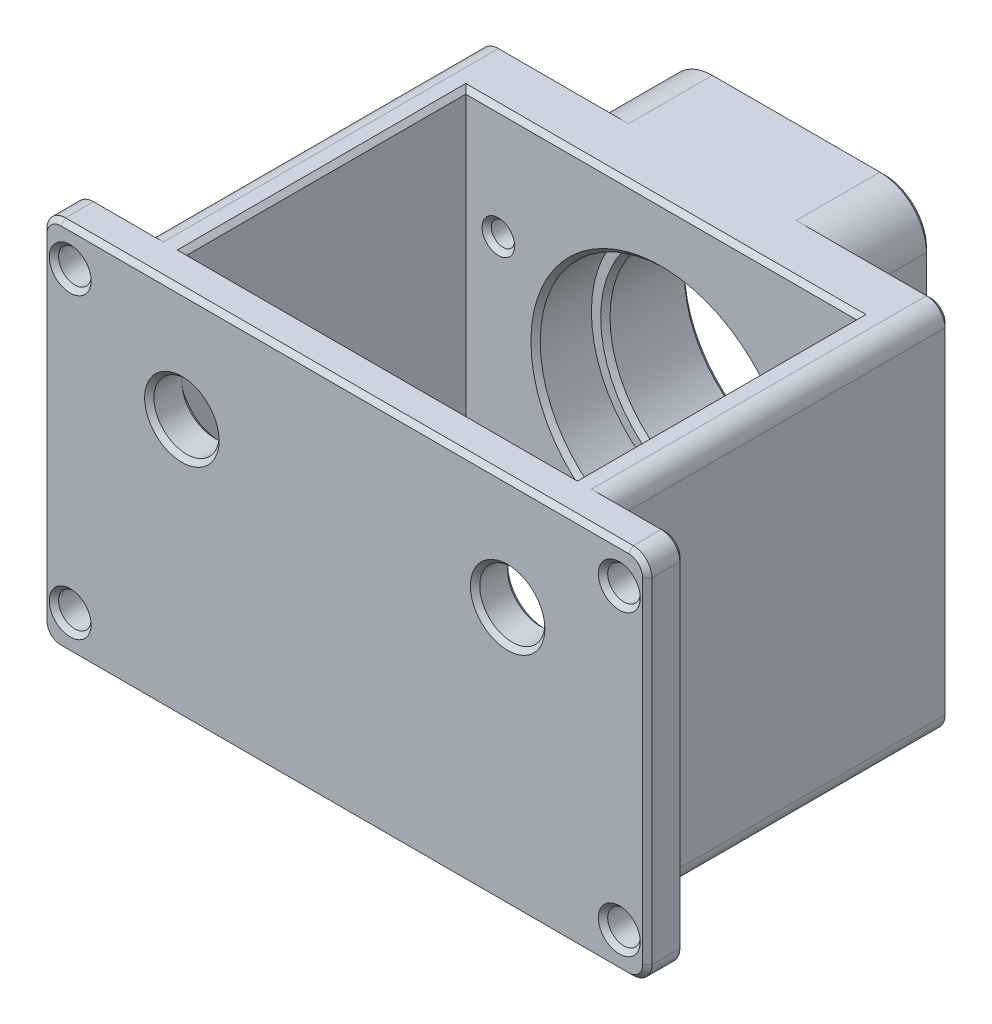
ISO-10303-21;
HEADER;
FILE_DESCRIPTION(('STEP AP214'),'2;1');
FILE_NAME('part.step','',(''),(''),'','','');
FILE_SCHEMA(('AUTOMOTIVE_DESIGN { 1 0 10303 214 1 1 1 1 }'));
ENDSEC;
DATA;
#1=APPLICATION_CONTEXT('core data for automotive mechanical design processes');
#2=APPLICATION_PROTOCOL_DEFINITION('international standard','automotive_design',2000,#1);
#3=PRODUCT_CONTEXT('',#1,'mechanical');
#4=PRODUCT('Part','Part','',(#3));
#5=PRODUCT_RELATED_PRODUCT_CATEGORY('part','',(#4));
#6=PRODUCT_DEFINITION_FORMATION('','',#4);
#7=PRODUCT_DEFINITION_CONTEXT('part definition',#1,'design');
#8=PRODUCT_DEFINITION('design','',#6,#7);
#9=PRODUCT_DEFINITION_SHAPE('','',#8);
#10=(LENGTH_UNIT() NAMED_UNIT(*) SI_UNIT(.MILLI.,.METRE.));
#11=(NAMED_UNIT(*) PLANE_ANGLE_UNIT() SI_UNIT($,.RADIAN.));
#12=(NAMED_UNIT(*) SI_UNIT($,.STERADIAN.) SOLID_ANGLE_UNIT());
#13=UNCERTAINTY_MEASURE_WITH_UNIT(LENGTH_MEASURE(1.E-05),#10,'distance_accuracy_value','');
#14=(GEOMETRIC_REPRESENTATION_CONTEXT(3) GLOBAL_UNCERTAINTY_ASSIGNED_CONTEXT((#13)) GLOBAL_UNIT_ASSIGNED_CONTEXT((#10,
#11,#12)) REPRESENTATION_CONTEXT('',''));
#15=CARTESIAN_POINT('',(0.,0.,0.));
#16=DIRECTION('',(0.,0.,1.));
#17=DIRECTION('',(1.,0.,0.));
#18=AXIS2_PLACEMENT_3D('',#15,#16,#17);
#19=CARTESIAN_POINT('',(0.,0.,15.));
#20=DIRECTION('',(0.,0.,-1.));
#21=DIRECTION('',(-1.,0.,0.));
#22=AXIS2_PLACEMENT_3D('',#19,#20,#21);
#23=PLANE('',#22);
#24=CARTESIAN_POINT('',(17.5,8.,15.));
#25=DIRECTION('',(0.,0.,-1.));
#26=DIRECTION('',(-1.,0.,0.));
#27=AXIS2_PLACEMENT_3D('',#24,#25,#26);
#28=CIRCLE('',#27,1.74999999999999);
#29=CARTESIAN_POINT('',(15.75,8.,15.));
#30=VERTEX_POINT('',#29);
#31=EDGE_CURVE('E517',#30,#30,#28,.T.);
#32=ORIENTED_EDGE('',*,*,#31,.T.);
#33=EDGE_LOOP('',(#32));
#34=FACE_BOUND('',#33,.T.);
#35=CARTESIAN_POINT('',(-17.5,8.,15.));
#36=DIRECTION('',(0.,0.,-1.));
#37=DIRECTION('',(-1.,0.,0.));
#38=AXIS2_PLACEMENT_3D('',#35,#36,#37);
#39=CIRCLE('',#38,1.74999999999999);
#40=CARTESIAN_POINT('',(-19.25,8.,15.));
#41=VERTEX_POINT('',#40);
#42=EDGE_CURVE('E514',#41,#41,#39,.T.);
#43=ORIENTED_EDGE('',*,*,#42,.T.);
#44=EDGE_LOOP('',(#43));
#45=FACE_BOUND('',#44,.T.);
#46=CARTESIAN_POINT('',(0.,0.,15.));
#47=DIRECTION('',(0.,0.,-1.));
#48=DIRECTION('',(-1.,0.,0.));
#49=AXIS2_PLACEMENT_3D('',#46,#47,#48);
#50=CIRCLE('',#49,14.);
#51=CARTESIAN_POINT('',(-14.,0.,15.));
#52=VERTEX_POINT('',#51);
#53=EDGE_CURVE('E511',#52,#52,#50,.T.);
#54=ORIENTED_EDGE('',*,*,#53,.T.);
#55=EDGE_LOOP('',(#54));
#56=FACE_BOUND('',#55,.T.);
#57=DIRECTION('',(0.,1.,0.));
#58=VECTOR('',#57,1.);
#59=CARTESIAN_POINT('',(-21.,20.,15.));
#60=LINE('',#59,#58);
#61=CARTESIAN_POINT('',(-21.,-19.5,15.));
#62=VERTEX_POINT('',#61);
#63=CARTESIAN_POINT('',(-21.,19.5,15.));
#64=VERTEX_POINT('',#63);
#65=EDGE_CURVE('E1041',#62,#64,#60,.T.);
#66=ORIENTED_EDGE('',*,*,#65,.F.);
#67=DIRECTION('',(1.,0.,0.));
#68=VECTOR('',#67,1.);
#69=CARTESIAN_POINT('',(0.,-19.5,15.));
#70=LINE('',#69,#68);
#71=CARTESIAN_POINT('',(21.,-19.5,15.));
#72=VERTEX_POINT('',#71);
#73=EDGE_CURVE('E509',#62,#72,#70,.T.);
#74=ORIENTED_EDGE('',*,*,#73,.T.);
#75=DIRECTION('',(0.,-1.,0.));
#76=VECTOR('',#75,1.);
#77=CARTESIAN_POINT('',(21.,20.,15.));
#78=LINE('',#77,#76);
#79=CARTESIAN_POINT('',(21.,19.5,15.));
#80=VERTEX_POINT('',#79);
#81=EDGE_CURVE('E1022',#80,#72,#78,.T.);
#82=ORIENTED_EDGE('',*,*,#81,.F.);
#83=DIRECTION('',(-1.,0.,0.));
#84=VECTOR('',#83,1.);
#85=CARTESIAN_POINT('',(0.,19.5,15.));
#86=LINE('',#85,#84);
#87=EDGE_CURVE('E507',#80,#64,#86,.T.);
#88=ORIENTED_EDGE('',*,*,#87,.T.);
#89=EDGE_LOOP('',(#66,#74,#82,#88));
#90=FACE_BOUND('',#89,.T.);
#91=ADVANCED_FACE('F37',(#34,#45,#56,#90),#23,.F.);
#92=CARTESIAN_POINT('',(0.,0.,0.));
#93=DIRECTION('',(0.,0.,-1.));
#94=DIRECTION('',(-1.,0.,0.));
#95=AXIS2_PLACEMENT_3D('',#92,#93,#94);
#96=PLANE('',#95);
#97=CARTESIAN_POINT('',(0.,0.,0.));
#98=DIRECTION('',(0.,0.,-1.));
#99=DIRECTION('',(-1.,0.,0.));
#100=AXIS2_PLACEMENT_3D('',#97,#98,#99);
#101=CIRCLE('',#100,12.5);
#102=CARTESIAN_POINT('',(-12.5,0.,0.));
#103=VERTEX_POINT('',#102);
#104=EDGE_CURVE('E690',#103,#103,#101,.F.);
#105=ORIENTED_EDGE('',*,*,#104,.T.);
#106=EDGE_LOOP('',(#105));
#107=FACE_BOUND('',#106,.T.);
#108=DIRECTION('',(0.,-1.,0.));
#109=VECTOR('',#108,1.);
#110=CARTESIAN_POINT('',(13.5,-15.,0.));
#111=LINE('',#110,#109);
#112=CARTESIAN_POINT('',(13.5,15.,0.));
#113=VERTEX_POINT('',#112);
#114=CARTESIAN_POINT('',(13.5,-15.,0.));
#115=VERTEX_POINT('',#114);
#116=EDGE_CURVE('E685',#113,#115,#111,.T.);
#117=ORIENTED_EDGE('',*,*,#116,.T.);
#118=CARTESIAN_POINT('',(9.,-15.,0.));
#119=DIRECTION('',(0.,0.,-1.));
#120=DIRECTION('',(-1.,0.,0.));
#121=AXIS2_PLACEMENT_3D('',#118,#119,#120);
#122=CIRCLE('',#121,4.50000000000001);
#123=CARTESIAN_POINT('',(9.,-19.5,0.));
#124=VERTEX_POINT('',#123);
#125=EDGE_CURVE('E687',#115,#124,#122,.T.);
#126=ORIENTED_EDGE('',*,*,#125,.T.);
#127=DIRECTION('',(-1.,0.,0.));
#128=VECTOR('',#127,1.);
#129=CARTESIAN_POINT('',(-9.,-19.5,0.));
#130=LINE('',#129,#128);
#131=CARTESIAN_POINT('',(-9.,-19.5,0.));
#132=VERTEX_POINT('',#131);
#133=EDGE_CURVE('E673',#124,#132,#130,.T.);
#134=ORIENTED_EDGE('',*,*,#133,.T.);
#135=CARTESIAN_POINT('',(-9.,-15.,0.));
#136=DIRECTION('',(0.,0.,-1.));
#137=DIRECTION('',(-1.,0.,0.));
#138=AXIS2_PLACEMENT_3D('',#135,#136,#137);
#139=CIRCLE('',#138,4.50000000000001);
#140=CARTESIAN_POINT('',(-13.5,-15.,0.));
#141=VERTEX_POINT('',#140);
#142=EDGE_CURVE('E675',#132,#141,#139,.T.);
#143=ORIENTED_EDGE('',*,*,#142,.T.);
#144=DIRECTION('',(0.,1.,0.));
#145=VECTOR('',#144,1.);
#146=CARTESIAN_POINT('',(-13.5,15.,0.));
#147=LINE('',#146,#145);
#148=CARTESIAN_POINT('',(-13.5,15.,0.));
#149=VERTEX_POINT('',#148);
#150=EDGE_CURVE('E677',#141,#149,#147,.T.);
#151=ORIENTED_EDGE('',*,*,#150,.T.);
#152=CARTESIAN_POINT('',(-9.,15.,0.));
#153=DIRECTION('',(0.,0.,-1.));
#154=DIRECTION('',(-1.,0.,0.));
#155=AXIS2_PLACEMENT_3D('',#152,#153,#154);
#156=CIRCLE('',#155,4.50000000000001);
#157=CARTESIAN_POINT('',(-9.,19.5,0.));
#158=VERTEX_POINT('',#157);
#159=EDGE_CURVE('E679',#149,#158,#156,.T.);
#160=ORIENTED_EDGE('',*,*,#159,.T.);
#161=DIRECTION('',(1.,0.,0.));
#162=VECTOR('',#161,1.);
#163=CARTESIAN_POINT('',(9.00000000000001,19.5,0.));
#164=LINE('',#163,#162);
#165=CARTESIAN_POINT('',(9.,19.5,0.));
#166=VERTEX_POINT('',#165);
#167=EDGE_CURVE('E681',#158,#166,#164,.T.);
#168=ORIENTED_EDGE('',*,*,#167,.T.);
#169=CARTESIAN_POINT('',(9.,15.,0.));
#170=DIRECTION('',(0.,0.,-1.));
#171=DIRECTION('',(-1.,0.,0.));
#172=AXIS2_PLACEMENT_3D('',#169,#170,#171);
#173=CIRCLE('',#172,4.50000000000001);
#174=EDGE_CURVE('E683',#166,#113,#173,.T.);
#175=ORIENTED_EDGE('',*,*,#174,.T.);
#176=EDGE_LOOP('',(#117,#126,#134,#143,#151,#160,#168,#175));
#177=FACE_BOUND('',#176,.T.);
#178=ADVANCED_FACE('F823',(#107,#177),#96,.T.);
#179=CARTESIAN_POINT('',(25.,-20.,15.));
#180=DIRECTION('',(-1.,0.,0.));
#181=DIRECTION('',(0.,0.,1.));
#182=AXIS2_PLACEMENT_3D('',#179,#180,#181);
#183=PLANE('',#182);
#184=DIRECTION('',(0.,0.,-1.));
#185=VECTOR('',#184,1.);
#186=CARTESIAN_POINT('',(25.,-18.,15.));
#187=LINE('',#186,#185);
#188=CARTESIAN_POINT('',(25.,-18.,45.));
#189=VERTEX_POINT('',#188);
#190=CARTESIAN_POINT('',(25.,-18.,9.5));
#191=VERTEX_POINT('',#190);
#192=EDGE_CURVE('E465',#189,#191,#187,.T.);
#193=ORIENTED_EDGE('',*,*,#192,.T.);
#194=DIRECTION('',(0.,1.,0.));
#195=VECTOR('',#194,1.);
#196=CARTESIAN_POINT('',(25.,-20.,9.5));
#197=LINE('',#196,#195);
#198=CARTESIAN_POINT('',(25.,18.,9.5));
#199=VERTEX_POINT('',#198);
#200=EDGE_CURVE('E716',#191,#199,#197,.T.);
#201=ORIENTED_EDGE('',*,*,#200,.T.);
#202=DIRECTION('',(0.,0.,-1.));
#203=VECTOR('',#202,1.);
#204=CARTESIAN_POINT('',(25.,18.,15.));
#205=LINE('',#204,#203);
#206=CARTESIAN_POINT('',(25.,18.,45.));
#207=VERTEX_POINT('',#206);
#208=EDGE_CURVE('E463',#199,#207,#205,.F.);
#209=ORIENTED_EDGE('',*,*,#208,.T.);
#210=DIRECTION('',(0.,1.,0.));
#211=VECTOR('',#210,1.);
#212=CARTESIAN_POINT('',(25.,20.,45.));
#213=LINE('',#212,#211);
#214=EDGE_CURVE('E931',#189,#207,#213,.T.);
#215=ORIENTED_EDGE('',*,*,#214,.F.);
#216=EDGE_LOOP('',(#193,#201,#209,#215));
#217=FACE_BOUND('',#216,.T.);
#218=ADVANCED_FACE('F827',(#217),#183,.F.);
#219=CARTESIAN_POINT('',(-25.,20.,15.));
#220=DIRECTION('',(0.,-1.,0.));
#221=DIRECTION('',(0.,0.,-1.));
#222=AXIS2_PLACEMENT_3D('',#219,#220,#221);
#223=PLANE('',#222);
#224=DIRECTION('',(1.,0.,0.));
#225=VECTOR('',#224,1.);
#226=CARTESIAN_POINT('',(-25.,20.,14.5));
#227=LINE('',#226,#225);
#228=CARTESIAN_POINT('',(-21.5,20.,14.5));
#229=VERTEX_POINT('',#228);
#230=CARTESIAN_POINT('',(21.5,20.,14.5));
#231=VERTEX_POINT('',#230);
#232=EDGE_CURVE('E643',#229,#231,#227,.T.);
#233=ORIENTED_EDGE('',*,*,#232,.T.);
#234=DIRECTION('',(0.,0.,1.));
#235=VECTOR('',#234,1.);
#236=CARTESIAN_POINT('',(21.5,20.,15.));
#237=LINE('',#236,#235);
#238=CARTESIAN_POINT('',(21.5,20.,45.5));
#239=VERTEX_POINT('',#238);
#240=EDGE_CURVE('E649',#231,#239,#237,.T.);
#241=ORIENTED_EDGE('',*,*,#240,.T.);
#242=DIRECTION('',(-1.,0.,0.));
#243=VECTOR('',#242,1.);
#244=CARTESIAN_POINT('',(-25.,20.,45.5));
#245=LINE('',#244,#243);
#246=CARTESIAN_POINT('',(-21.5,20.,45.5));
#247=VERTEX_POINT('',#246);
#248=EDGE_CURVE('E647',#239,#247,#245,.T.);
#249=ORIENTED_EDGE('',*,*,#248,.T.);
#250=DIRECTION('',(0.,0.,-1.));
#251=VECTOR('',#250,1.);
#252=CARTESIAN_POINT('',(-21.5,20.,15.));
#253=LINE('',#252,#251);
#254=EDGE_CURVE('E645',#247,#229,#253,.T.);
#255=ORIENTED_EDGE('',*,*,#254,.T.);
#256=EDGE_LOOP('',(#233,#241,#249,#255));
#257=FACE_BOUND('',#256,.T.);
#258=DIRECTION('',(0.,0.,-1.));
#259=VECTOR('',#258,1.);
#260=CARTESIAN_POINT('',(-30.5,20.,15.));
#261=LINE('',#260,#259);
#262=CARTESIAN_POINT('',(-30.5,20.,45.5));
#263=VERTEX_POINT('',#262);
#264=CARTESIAN_POINT('',(-30.5,20.,48.5));
#265=VERTEX_POINT('',#264);
#266=EDGE_CURVE('E438',#263,#265,#261,.F.);
#267=ORIENTED_EDGE('',*,*,#266,.T.);
#268=DIRECTION('',(1.,0.,0.));
#269=VECTOR('',#268,1.);
#270=CARTESIAN_POINT('',(30.5,20.,48.5));
#271=LINE('',#270,#269);
#272=CARTESIAN_POINT('',(30.5,20.,48.5));
#273=VERTEX_POINT('',#272);
#274=EDGE_CURVE('E665',#265,#273,#271,.T.);
#275=ORIENTED_EDGE('',*,*,#274,.T.);
#276=DIRECTION('',(0.,0.,-1.));
#277=VECTOR('',#276,1.);
#278=CARTESIAN_POINT('',(30.5,20.,15.));
#279=LINE('',#278,#277);
#280=CARTESIAN_POINT('',(30.5,20.,45.5));
#281=VERTEX_POINT('',#280);
#282=EDGE_CURVE('E435',#273,#281,#279,.T.);
#283=ORIENTED_EDGE('',*,*,#282,.T.);
#284=DIRECTION('',(-1.,0.,0.));
#285=VECTOR('',#284,1.);
#286=CARTESIAN_POINT('',(-25.,20.,45.5));
#287=LINE('',#286,#285);
#288=CARTESIAN_POINT('',(23.,20.,45.5));
#289=VERTEX_POINT('',#288);
#290=EDGE_CURVE('E655',#281,#289,#287,.T.);
#291=ORIENTED_EDGE('',*,*,#290,.T.);
#292=DIRECTION('',(0.,0.,-1.));
#293=VECTOR('',#292,1.);
#294=CARTESIAN_POINT('',(23.,20.,15.));
#295=LINE('',#294,#293);
#296=CARTESIAN_POINT('',(23.,20.,9.5));
#297=VERTEX_POINT('',#296);
#298=EDGE_CURVE('E430',#289,#297,#295,.T.);
#299=ORIENTED_EDGE('',*,*,#298,.T.);
#300=DIRECTION('',(-1.,0.,0.));
#301=VECTOR('',#300,1.);
#302=CARTESIAN_POINT('',(-25.,20.,9.50000000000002));
#303=LINE('',#302,#301);
#304=CARTESIAN_POINT('',(9.,20.,9.50000000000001));
#305=VERTEX_POINT('',#304);
#306=EDGE_CURVE('E660',#297,#305,#303,.T.);
#307=ORIENTED_EDGE('',*,*,#306,.T.);
#308=DIRECTION('',(0.,0.,1.));
#309=VECTOR('',#308,1.);
#310=CARTESIAN_POINT('',(9.00000000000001,20.,15.));
#311=LINE('',#310,#309);
#312=CARTESIAN_POINT('',(9.,20.,0.499999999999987));
#313=VERTEX_POINT('',#312);
#314=EDGE_CURVE('E412',#305,#313,#311,.F.);
#315=ORIENTED_EDGE('',*,*,#314,.T.);
#316=DIRECTION('',(-1.,0.,0.));
#317=VECTOR('',#316,1.);
#318=CARTESIAN_POINT('',(-9.,20.,0.499999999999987));
#319=LINE('',#318,#317);
#320=CARTESIAN_POINT('',(-9.,20.,0.499999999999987));
#321=VERTEX_POINT('',#320);
#322=EDGE_CURVE('E663',#313,#321,#319,.T.);
#323=ORIENTED_EDGE('',*,*,#322,.T.);
#324=DIRECTION('',(0.,0.,-1.));
#325=VECTOR('',#324,1.);
#326=CARTESIAN_POINT('',(-9.,20.,15.));
#327=LINE('',#326,#325);
#328=CARTESIAN_POINT('',(-9.,20.,9.49999999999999));
#329=VERTEX_POINT('',#328);
#330=EDGE_CURVE('E417',#321,#329,#327,.F.);
#331=ORIENTED_EDGE('',*,*,#330,.T.);
#332=DIRECTION('',(-1.,0.,0.));
#333=VECTOR('',#332,1.);
#334=CARTESIAN_POINT('',(-25.,20.,9.49999999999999));
#335=LINE('',#334,#333);
#336=CARTESIAN_POINT('',(-23.,20.,9.49999999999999));
#337=VERTEX_POINT('',#336);
#338=EDGE_CURVE('E658',#329,#337,#335,.T.);
#339=ORIENTED_EDGE('',*,*,#338,.T.);
#340=DIRECTION('',(0.,0.,-1.));
#341=VECTOR('',#340,1.);
#342=CARTESIAN_POINT('',(-23.,20.,15.));
#343=LINE('',#342,#341);
#344=CARTESIAN_POINT('',(-23.,20.,45.5));
#345=VERTEX_POINT('',#344);
#346=EDGE_CURVE('E433',#337,#345,#343,.F.);
#347=ORIENTED_EDGE('',*,*,#346,.T.);
#348=DIRECTION('',(-1.,0.,0.));
#349=VECTOR('',#348,1.);
#350=CARTESIAN_POINT('',(-25.,20.,45.5));
#351=LINE('',#350,#349);
#352=EDGE_CURVE('E652',#345,#263,#351,.T.);
#353=ORIENTED_EDGE('',*,*,#352,.T.);
#354=EDGE_LOOP('',(#267,#275,#283,#291,#299,#307,#315,#323,#331,#339,#347,#353));
#355=FACE_BOUND('',#354,.T.);
#356=ADVANCED_FACE('F835',(#257,#355),#223,.F.);
#357=CARTESIAN_POINT('',(-25.,-20.,15.));
#358=DIRECTION('',(1.,0.,0.));
#359=DIRECTION('',(0.,0.,-1.));
#360=AXIS2_PLACEMENT_3D('',#357,#358,#359);
#361=PLANE('',#360);
#362=DIRECTION('',(0.,0.,-1.));
#363=VECTOR('',#362,1.);
#364=CARTESIAN_POINT('',(-25.,18.,15.));
#365=LINE('',#364,#363);
#366=CARTESIAN_POINT('',(-25.,18.,45.));
#367=VERTEX_POINT('',#366);
#368=CARTESIAN_POINT('',(-25.,18.,9.49999999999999));
#369=VERTEX_POINT('',#368);
#370=EDGE_CURVE('E460',#367,#369,#365,.T.);
#371=ORIENTED_EDGE('',*,*,#370,.T.);
#372=DIRECTION('',(0.,-1.,0.));
#373=VECTOR('',#372,1.);
#374=CARTESIAN_POINT('',(-25.,-20.,9.49999999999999));
#375=LINE('',#374,#373);
#376=CARTESIAN_POINT('',(-25.,-18.,9.49999999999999));
#377=VERTEX_POINT('',#376);
#378=EDGE_CURVE('E722',#369,#377,#375,.T.);
#379=ORIENTED_EDGE('',*,*,#378,.T.);
#380=DIRECTION('',(0.,0.,-1.));
#381=VECTOR('',#380,1.);
#382=CARTESIAN_POINT('',(-25.,-18.,15.));
#383=LINE('',#382,#381);
#384=CARTESIAN_POINT('',(-25.,-18.,45.));
#385=VERTEX_POINT('',#384);
#386=EDGE_CURVE('E458',#377,#385,#383,.F.);
#387=ORIENTED_EDGE('',*,*,#386,.T.);
#388=DIRECTION('',(0.,-1.,0.));
#389=VECTOR('',#388,1.);
#390=CARTESIAN_POINT('',(-25.,20.,45.));
#391=LINE('',#390,#389);
#392=EDGE_CURVE('E1037',#367,#385,#391,.T.);
#393=ORIENTED_EDGE('',*,*,#392,.F.);
#394=EDGE_LOOP('',(#371,#379,#387,#393));
#395=FACE_BOUND('',#394,.T.);
#396=ADVANCED_FACE('F831',(#395),#361,.F.);
#397=CARTESIAN_POINT('',(-25.,-20.,15.));
#398=DIRECTION('',(0.,1.,0.));
#399=DIRECTION('',(0.,0.,1.));
#400=AXIS2_PLACEMENT_3D('',#397,#398,#399);
#401=PLANE('',#400);
#402=DIRECTION('',(0.,0.,1.));
#403=VECTOR('',#402,1.);
#404=CARTESIAN_POINT('',(-21.5,-20.,15.));
#405=LINE('',#404,#403);
#406=CARTESIAN_POINT('',(-21.5,-20.,14.5));
#407=VERTEX_POINT('',#406);
#408=CARTESIAN_POINT('',(-21.5,-20.,45.5));
#409=VERTEX_POINT('',#408);
#410=EDGE_CURVE('E611',#407,#409,#405,.T.);
#411=ORIENTED_EDGE('',*,*,#410,.T.);
#412=DIRECTION('',(1.,0.,0.));
#413=VECTOR('',#412,1.);
#414=CARTESIAN_POINT('',(-25.,-20.,45.5));
#415=LINE('',#414,#413);
#416=CARTESIAN_POINT('',(21.5,-20.,45.5));
#417=VERTEX_POINT('',#416);
#418=EDGE_CURVE('E613',#409,#417,#415,.T.);
#419=ORIENTED_EDGE('',*,*,#418,.T.);
#420=DIRECTION('',(0.,0.,-1.));
#421=VECTOR('',#420,1.);
#422=CARTESIAN_POINT('',(21.5,-20.,15.));
#423=LINE('',#422,#421);
#424=CARTESIAN_POINT('',(21.5,-20.,14.5));
#425=VERTEX_POINT('',#424);
#426=EDGE_CURVE('E609',#417,#425,#423,.T.);
#427=ORIENTED_EDGE('',*,*,#426,.T.);
#428=DIRECTION('',(-1.,0.,0.));
#429=VECTOR('',#428,1.);
#430=CARTESIAN_POINT('',(-25.,-20.,14.5));
#431=LINE('',#430,#429);
#432=EDGE_CURVE('E607',#425,#407,#431,.T.);
#433=ORIENTED_EDGE('',*,*,#432,.T.);
#434=EDGE_LOOP('',(#411,#419,#427,#433));
#435=FACE_BOUND('',#434,.T.);
#436=DIRECTION('',(0.,0.,-1.));
#437=VECTOR('',#436,1.);
#438=CARTESIAN_POINT('',(30.5,-20.,15.));
#439=LINE('',#438,#437);
#440=CARTESIAN_POINT('',(30.5,-20.,45.5));
#441=VERTEX_POINT('',#440);
#442=CARTESIAN_POINT('',(30.5,-20.,48.5));
#443=VERTEX_POINT('',#442);
#444=EDGE_CURVE('E446',#441,#443,#439,.F.);
#445=ORIENTED_EDGE('',*,*,#444,.T.);
#446=DIRECTION('',(-1.,0.,0.));
#447=VECTOR('',#446,1.);
#448=CARTESIAN_POINT('',(-30.5,-20.,48.5));
#449=LINE('',#448,#447);
#450=CARTESIAN_POINT('',(-30.5,-20.,48.5));
#451=VERTEX_POINT('',#450);
#452=EDGE_CURVE('E629',#443,#451,#449,.T.);
#453=ORIENTED_EDGE('',*,*,#452,.T.);
#454=DIRECTION('',(0.,0.,-1.));
#455=VECTOR('',#454,1.);
#456=CARTESIAN_POINT('',(-30.5,-20.,15.));
#457=LINE('',#456,#455);
#458=CARTESIAN_POINT('',(-30.5,-20.,45.5));
#459=VERTEX_POINT('',#458);
#460=EDGE_CURVE('E449',#451,#459,#457,.T.);
#461=ORIENTED_EDGE('',*,*,#460,.T.);
#462=DIRECTION('',(1.,0.,0.));
#463=VECTOR('',#462,1.);
#464=CARTESIAN_POINT('',(-25.,-20.,45.5));
#465=LINE('',#464,#463);
#466=CARTESIAN_POINT('',(-23.,-20.,45.5));
#467=VERTEX_POINT('',#466);
#468=EDGE_CURVE('E616',#459,#467,#465,.T.);
#469=ORIENTED_EDGE('',*,*,#468,.T.);
#470=DIRECTION('',(0.,0.,-1.));
#471=VECTOR('',#470,1.);
#472=CARTESIAN_POINT('',(-23.,-20.,15.));
#473=LINE('',#472,#471);
#474=CARTESIAN_POINT('',(-23.,-20.,9.49999999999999));
#475=VERTEX_POINT('',#474);
#476=EDGE_CURVE('E443',#467,#475,#473,.T.);
#477=ORIENTED_EDGE('',*,*,#476,.T.);
#478=DIRECTION('',(1.,0.,0.));
#479=VECTOR('',#478,1.);
#480=CARTESIAN_POINT('',(-25.,-20.,9.49999999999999));
#481=LINE('',#480,#479);
#482=CARTESIAN_POINT('',(-9.,-20.,9.49999999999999));
#483=VERTEX_POINT('',#482);
#484=EDGE_CURVE('E622',#475,#483,#481,.T.);
#485=ORIENTED_EDGE('',*,*,#484,.T.);
#486=DIRECTION('',(0.,0.,-1.));
#487=VECTOR('',#486,1.);
#488=CARTESIAN_POINT('',(-9.,-20.,15.));
#489=LINE('',#488,#487);
#490=CARTESIAN_POINT('',(-9.,-20.,0.499999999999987));
#491=VERTEX_POINT('',#490);
#492=EDGE_CURVE('E1047',#483,#491,#489,.T.);
#493=ORIENTED_EDGE('',*,*,#492,.T.);
#494=DIRECTION('',(1.,0.,0.));
#495=VECTOR('',#494,1.);
#496=CARTESIAN_POINT('',(9.00000000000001,-20.,0.499999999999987));
#497=LINE('',#496,#495);
#498=CARTESIAN_POINT('',(9.,-20.,0.499999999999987));
#499=VERTEX_POINT('',#498);
#500=EDGE_CURVE('E627',#491,#499,#497,.T.);
#501=ORIENTED_EDGE('',*,*,#500,.T.);
#502=DIRECTION('',(0.,0.,1.));
#503=VECTOR('',#502,1.);
#504=CARTESIAN_POINT('',(9.00000000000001,-20.,15.));
#505=LINE('',#504,#503);
#506=CARTESIAN_POINT('',(9.,-20.,9.50000000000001));
#507=VERTEX_POINT('',#506);
#508=EDGE_CURVE('E1044',#499,#507,#505,.T.);
#509=ORIENTED_EDGE('',*,*,#508,.T.);
#510=DIRECTION('',(1.,0.,0.));
#511=VECTOR('',#510,1.);
#512=CARTESIAN_POINT('',(-25.,-20.,9.50000000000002));
#513=LINE('',#512,#511);
#514=CARTESIAN_POINT('',(23.,-20.,9.5));
#515=VERTEX_POINT('',#514);
#516=EDGE_CURVE('E625',#507,#515,#513,.T.);
#517=ORIENTED_EDGE('',*,*,#516,.T.);
#518=DIRECTION('',(0.,0.,-1.));
#519=VECTOR('',#518,1.);
#520=CARTESIAN_POINT('',(23.,-20.,15.));
#521=LINE('',#520,#519);
#522=CARTESIAN_POINT('',(23.,-20.,45.5));
#523=VERTEX_POINT('',#522);
#524=EDGE_CURVE('E441',#515,#523,#521,.F.);
#525=ORIENTED_EDGE('',*,*,#524,.T.);
#526=DIRECTION('',(1.,0.,0.));
#527=VECTOR('',#526,1.);
#528=CARTESIAN_POINT('',(-25.,-20.,45.5));
#529=LINE('',#528,#527);
#530=EDGE_CURVE('E619',#523,#441,#529,.T.);
#531=ORIENTED_EDGE('',*,*,#530,.T.);
#532=EDGE_LOOP('',(#445,#453,#461,#469,#477,#485,#493,#501,#509,#517,#525,#531));
#533=FACE_BOUND('',#532,.T.);
#534=ADVANCED_FACE('F819',(#435,#533),#401,.F.);
#535=CARTESIAN_POINT('',(0.,0.,15.));
#536=DIRECTION('',(0.,0.,-1.));
#537=DIRECTION('',(-1.,0.,0.));
#538=AXIS2_PLACEMENT_3D('',#535,#536,#537);
#539=CYLINDRICAL_SURFACE('',#538,12.);
#540=CARTESIAN_POINT('',(0.,0.,0.499999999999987));
#541=DIRECTION('',(0.,0.,-1.));
#542=DIRECTION('',(-1.,0.,0.));
#543=AXIS2_PLACEMENT_3D('',#540,#541,#542);
#544=CIRCLE('',#543,12.);
#545=CARTESIAN_POINT('',(-12.,0.,0.499999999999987));
#546=VERTEX_POINT('',#545);
#547=EDGE_CURVE('E696',#546,#546,#544,.T.);
#548=ORIENTED_EDGE('',*,*,#547,.T.);
#549=EDGE_LOOP('',(#548));
#550=FACE_BOUND('',#549,.T.);
#551=CARTESIAN_POINT('',(0.,0.,8.50000000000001));
#552=DIRECTION('',(0.,0.,-1.));
#553=DIRECTION('',(-1.,0.,0.));
#554=AXIS2_PLACEMENT_3D('',#551,#552,#553);
#555=CIRCLE('',#554,12.);
#556=CARTESIAN_POINT('',(-12.,0.,8.50000000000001));
#557=VERTEX_POINT('',#556);
#558=EDGE_CURVE('E693',#557,#557,#555,.F.);
#559=ORIENTED_EDGE('',*,*,#558,.T.);
#560=EDGE_LOOP('',(#559));
#561=FACE_BOUND('',#560,.T.);
#562=ADVANCED_FACE('F815',(#550,#561),#539,.F.);
#563=CARTESIAN_POINT('',(-17.5,8.,15.));
#564=DIRECTION('',(0.,0.,-1.));
#565=DIRECTION('',(-1.,0.,0.));
#566=AXIS2_PLACEMENT_3D('',#563,#564,#565);
#567=CYLINDRICAL_SURFACE('',#566,1.25);
#568=CARTESIAN_POINT('',(-17.5,8.,14.5));
#569=DIRECTION('',(0.,0.,-1.));
#570=DIRECTION('',(-1.,0.,0.));
#571=AXIS2_PLACEMENT_3D('',#568,#569,#570);
#572=CIRCLE('',#571,1.25);
#573=CARTESIAN_POINT('',(-18.75,8.,14.5));
#574=VERTEX_POINT('',#573);
#575=EDGE_CURVE('E537',#574,#574,#572,.F.);
#576=ORIENTED_EDGE('',*,*,#575,.T.);
#577=EDGE_LOOP('',(#576));
#578=FACE_BOUND('',#577,.T.);
#579=CARTESIAN_POINT('',(-17.5,8.,9.50000000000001));
#580=DIRECTION('',(0.,0.,1.));
#581=DIRECTION('',(1.,0.,0.));
#582=AXIS2_PLACEMENT_3D('',#579,#580,#581);
#583=CIRCLE('',#582,1.25);
#584=CARTESIAN_POINT('',(-16.25,8.,9.50000000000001));
#585=VERTEX_POINT('',#584);
#586=EDGE_CURVE('E534',#585,#585,#583,.F.);
#587=ORIENTED_EDGE('',*,*,#586,.T.);
#588=EDGE_LOOP('',(#587));
#589=FACE_BOUND('',#588,.T.);
#590=ADVANCED_FACE('F811',(#578,#589),#567,.F.);
#591=CARTESIAN_POINT('',(17.5,8.,15.));
#592=DIRECTION('',(0.,0.,-1.));
#593=DIRECTION('',(-1.,0.,0.));
#594=AXIS2_PLACEMENT_3D('',#591,#592,#593);
#595=CYLINDRICAL_SURFACE('',#594,1.25);
#596=CARTESIAN_POINT('',(17.5,8.,14.5));
#597=DIRECTION('',(0.,0.,-1.));
#598=DIRECTION('',(-1.,0.,0.));
#599=AXIS2_PLACEMENT_3D('',#596,#597,#598);
#600=CIRCLE('',#599,1.25);
#601=CARTESIAN_POINT('',(16.25,8.,14.5));
#602=VERTEX_POINT('',#601);
#603=EDGE_CURVE('E504',#602,#602,#600,.F.);
#604=ORIENTED_EDGE('',*,*,#603,.T.);
#605=EDGE_LOOP('',(#604));
#606=FACE_BOUND('',#605,.T.);
#607=CARTESIAN_POINT('',(17.5,8.,9.5));
#608=DIRECTION('',(0.,0.,1.));
#609=DIRECTION('',(1.,0.,0.));
#610=AXIS2_PLACEMENT_3D('',#607,#608,#609);
#611=CIRCLE('',#610,1.25);
#612=CARTESIAN_POINT('',(18.75,8.,9.5));
#613=VERTEX_POINT('',#612);
#614=EDGE_CURVE('E501',#613,#613,#611,.F.);
#615=ORIENTED_EDGE('',*,*,#614,.T.);
#616=EDGE_LOOP('',(#615));
#617=FACE_BOUND('',#616,.T.);
#618=ADVANCED_FACE('F806',(#606,#617),#595,.F.);
#619=CARTESIAN_POINT('',(-21.,20.,45.));
#620=DIRECTION('',(-1.,0.,0.));
#621=DIRECTION('',(0.,-1.,0.));
#622=AXIS2_PLACEMENT_3D('',#619,#620,#621);
#623=PLANE('',#622);
#624=DIRECTION('',(0.,1.,0.));
#625=VECTOR('',#624,1.);
#626=CARTESIAN_POINT('',(-21.,20.,45.));
#627=LINE('',#626,#625);
#628=CARTESIAN_POINT('',(-21.,-19.5,45.));
#629=VERTEX_POINT('',#628);
#630=CARTESIAN_POINT('',(-21.,6.0635083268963,45.));
#631=VERTEX_POINT('',#630);
#632=EDGE_CURVE('E1040',#629,#631,#627,.T.);
#633=ORIENTED_EDGE('',*,*,#632,.F.);
#634=DIRECTION('',(0.,0.,-1.));
#635=VECTOR('',#634,1.);
#636=CARTESIAN_POINT('',(-21.,-19.5,45.));
#637=LINE('',#636,#635);
#638=EDGE_CURVE('E749',#629,#62,#637,.T.);
#639=ORIENTED_EDGE('',*,*,#638,.T.);
#640=ORIENTED_EDGE('',*,*,#65,.T.);
#641=DIRECTION('',(0.,0.,1.));
#642=VECTOR('',#641,1.);
#643=CARTESIAN_POINT('',(-21.,19.5,45.));
#644=LINE('',#643,#642);
#645=CARTESIAN_POINT('',(-21.,19.5,45.));
#646=VERTEX_POINT('',#645);
#647=EDGE_CURVE('E747',#64,#646,#644,.T.);
#648=ORIENTED_EDGE('',*,*,#647,.T.);
#649=DIRECTION('',(0.,1.,0.));
#650=VECTOR('',#649,1.);
#651=CARTESIAN_POINT('',(-21.,20.,45.));
#652=LINE('',#651,#650);
#653=CARTESIAN_POINT('',(-21.,9.9364916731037,45.));
#654=VERTEX_POINT('',#653);
#655=EDGE_CURVE('E1028',#654,#646,#652,.T.);
#656=ORIENTED_EDGE('',*,*,#655,.F.);
#657=CARTESIAN_POINT('',(-21.,9.9364916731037,45.));
#658=CARTESIAN_POINT('',(-21.,9.80164497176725,45.0652372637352));
#659=CARTESIAN_POINT('',(-21.,9.66457098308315,45.1264247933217));
#660=CARTESIAN_POINT('',(-21.,9.38524046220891,45.2380432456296));
#661=CARTESIAN_POINT('',(-21.,9.24295879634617,45.2884107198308));
#662=CARTESIAN_POINT('',(-21.,8.95796414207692,45.3737391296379));
#663=CARTESIAN_POINT('',(-21.,8.81536858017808,45.4090825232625));
#664=CARTESIAN_POINT('',(-21.,8.52735518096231,45.4633017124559));
#665=CARTESIAN_POINT('',(-21.,8.38194636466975,45.4822233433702));
#666=CARTESIAN_POINT('',(-21.,8.19680671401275,45.4946920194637));
#667=CARTESIAN_POINT('',(-21.,8.15755846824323,45.4966762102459));
#668=CARTESIAN_POINT('',(-21.,8.07887588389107,45.4993319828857));
#669=CARTESIAN_POINT('',(-21.,8.03944138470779,45.4999988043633));
#670=CARTESIAN_POINT('',(-21.,8.,45.5));
#671=B_SPLINE_CURVE_WITH_KNOTS('',3,(#657,#658,#659,#660,#661,#662,#663,#664,#665,#666,#667,
#668,#669,#670),.UNSPECIFIED.,.F.,.F.,(4,2,2,2,2,2,4),(0.,0.449696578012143,0.901962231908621,
1.34190254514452,1.78061093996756,1.89849062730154,2.01679550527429),.UNSPECIFIED.);
#672=CARTESIAN_POINT('',(-21.,8.,45.5));
#673=VERTEX_POINT('',#672);
#674=EDGE_CURVE('E790',#654,#673,#671,.T.);
#675=ORIENTED_EDGE('',*,*,#674,.T.);
#676=CARTESIAN_POINT('',(-21.,8.,45.5));
#677=CARTESIAN_POINT('',(-21.,7.94625327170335,45.5000042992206));
#678=CARTESIAN_POINT('',(-21.,7.89251458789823,45.4987613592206));
#679=CARTESIAN_POINT('',(-21.,7.78515828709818,45.4938215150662));
#680=CARTESIAN_POINT('',(-21.,7.73154065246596,45.4901249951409));
#681=CARTESIAN_POINT('',(-21.,7.57120892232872,45.475434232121));
#682=CARTESIAN_POINT('',(-21.,7.46480693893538,45.4608384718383));
#683=CARTESIAN_POINT('',(-21.,7.2551964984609,45.423095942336));
#684=CARTESIAN_POINT('',(-21.,7.15196408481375,45.4000786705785));
#685=CARTESIAN_POINT('',(-21.,6.94746061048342,45.3464954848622));
#686=CARTESIAN_POINT('',(-21.,6.84619010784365,45.3159274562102));
#687=CARTESIAN_POINT('',(-21.,6.68791803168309,45.2625458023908));
#688=CARTESIAN_POINT('',(-21.,6.63018148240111,45.2418648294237));
#689=CARTESIAN_POINT('',(-21.,6.51546119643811,45.1985481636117));
#690=CARTESIAN_POINT('',(-21.,6.45847727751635,45.1759129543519));
#691=CARTESIAN_POINT('',(-21.,6.34473672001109,45.1286701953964));
#692=CARTESIAN_POINT('',(-21.,6.28798670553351,45.1040467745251));
#693=CARTESIAN_POINT('',(-21.,6.17520999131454,45.0531872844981));
#694=CARTESIAN_POINT('',(-21.,6.11918332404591,45.0269511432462));
#695=CARTESIAN_POINT('',(-21.,6.0635083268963,45.));
#696=B_SPLINE_CURVE_WITH_KNOTS('',3,(#676,#677,#678,#679,#680,#681,#682,#683,#684,#685,#686,
#687,#688,#689,#690,#691,#692,#693,#694,#695),.UNSPECIFIED.,.F.,.F.,(4,2,2,2,2,2,2,2,2,4),(0.,
0.161210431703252,0.322395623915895,0.644141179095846,0.961134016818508,1.27821573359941,
1.46217088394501,1.6460806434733,1.83164013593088,2.01720792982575),.UNSPECIFIED.);
#697=EDGE_CURVE('E795',#673,#631,#696,.T.);
#698=ORIENTED_EDGE('',*,*,#697,.T.);
#699=EDGE_LOOP('',(#633,#639,#640,#648,#656,#675,#698));
#700=FACE_BOUND('',#699,.T.);
#701=ADVANCED_FACE('F802',(#700),#623,.F.);
#702=CARTESIAN_POINT('',(21.,20.,45.));
#703=DIRECTION('',(1.,0.,0.));
#704=DIRECTION('',(0.,1.,0.));
#705=AXIS2_PLACEMENT_3D('',#702,#703,#704);
#706=PLANE('',#705);
#707=ORIENTED_EDGE('',*,*,#81,.T.);
#708=DIRECTION('',(0.,0.,1.));
#709=VECTOR('',#708,1.);
#710=CARTESIAN_POINT('',(21.,-19.5,45.));
#711=LINE('',#710,#709);
#712=CARTESIAN_POINT('',(21.,-19.5,45.));
#713=VERTEX_POINT('',#712);
#714=EDGE_CURVE('E754',#72,#713,#711,.T.);
#715=ORIENTED_EDGE('',*,*,#714,.T.);
#716=DIRECTION('',(0.,-1.,0.));
#717=VECTOR('',#716,1.);
#718=CARTESIAN_POINT('',(21.,20.,45.));
#719=LINE('',#718,#717);
#720=CARTESIAN_POINT('',(21.,6.06350832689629,45.));
#721=VERTEX_POINT('',#720);
#722=EDGE_CURVE('E1027',#721,#713,#719,.T.);
#723=ORIENTED_EDGE('',*,*,#722,.F.);
#724=CARTESIAN_POINT('',(21.,6.06350832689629,45.));
#725=CARTESIAN_POINT('',(21.,6.19835502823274,45.0652372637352));
#726=CARTESIAN_POINT('',(21.,6.33542901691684,45.1264247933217));
#727=CARTESIAN_POINT('',(21.,6.61475953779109,45.2380432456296));
#728=CARTESIAN_POINT('',(21.,6.75704120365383,45.2884107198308));
#729=CARTESIAN_POINT('',(21.,7.04203585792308,45.3737391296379));
#730=CARTESIAN_POINT('',(21.,7.18463141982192,45.4090825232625));
#731=CARTESIAN_POINT('',(21.,7.47264481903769,45.4633017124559));
#732=CARTESIAN_POINT('',(21.,7.61805363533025,45.4822233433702));
#733=CARTESIAN_POINT('',(21.,7.80319328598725,45.4946920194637));
#734=CARTESIAN_POINT('',(21.,7.84244153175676,45.4966762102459));
#735=CARTESIAN_POINT('',(21.,7.92112411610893,45.4993319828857));
#736=CARTESIAN_POINT('',(21.,7.96055861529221,45.4999988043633));
#737=CARTESIAN_POINT('',(21.,7.99999999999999,45.5));
#738=B_SPLINE_CURVE_WITH_KNOTS('',3,(#724,#725,#726,#727,#728,#729,#730,#731,#732,#733,#734,
#735,#736,#737),.UNSPECIFIED.,.F.,.F.,(4,2,2,2,2,2,4),(0.,0.449696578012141,0.901962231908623,
1.34190254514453,1.78061093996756,1.89849062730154,2.01679550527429),.UNSPECIFIED.);
#739=CARTESIAN_POINT('',(21.,7.99999999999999,45.5));
#740=VERTEX_POINT('',#739);
#741=EDGE_CURVE('E756',#721,#740,#738,.T.);
#742=ORIENTED_EDGE('',*,*,#741,.T.);
#743=CARTESIAN_POINT('',(21.,7.99999999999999,45.5));
#744=CARTESIAN_POINT('',(21.,8.05374672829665,45.5000042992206));
#745=CARTESIAN_POINT('',(21.,8.10748541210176,45.4987613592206));
#746=CARTESIAN_POINT('',(21.,8.21484171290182,45.4938215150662));
#747=CARTESIAN_POINT('',(21.,8.26845934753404,45.4901249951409));
#748=CARTESIAN_POINT('',(21.,8.42879107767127,45.475434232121));
#749=CARTESIAN_POINT('',(21.,8.53519306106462,45.4608384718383));
#750=CARTESIAN_POINT('',(21.,8.7448035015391,45.423095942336));
#751=CARTESIAN_POINT('',(21.,8.84803591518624,45.4000786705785));
#752=CARTESIAN_POINT('',(21.,9.05253938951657,45.3464954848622));
#753=CARTESIAN_POINT('',(21.,9.15380989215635,45.3159274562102));
#754=CARTESIAN_POINT('',(21.,9.3120819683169,45.2625458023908));
#755=CARTESIAN_POINT('',(21.,9.36981851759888,45.2418648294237));
#756=CARTESIAN_POINT('',(21.,9.48453880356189,45.1985481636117));
#757=CARTESIAN_POINT('',(21.,9.54152272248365,45.1759129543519));
#758=CARTESIAN_POINT('',(21.,9.65526327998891,45.1286701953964));
#759=CARTESIAN_POINT('',(21.,9.71201329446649,45.1040467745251));
#760=CARTESIAN_POINT('',(21.,9.82479000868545,45.0531872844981));
#761=CARTESIAN_POINT('',(21.,9.88081667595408,45.0269511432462));
#762=CARTESIAN_POINT('',(21.,9.93649167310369,45.));
#763=B_SPLINE_CURVE_WITH_KNOTS('',3,(#743,#744,#745,#746,#747,#748,#749,#750,#751,#752,#753,
#754,#755,#756,#757,#758,#759,#760,#761,#762),.UNSPECIFIED.,.F.,.F.,(4,2,2,2,2,2,2,2,2,4),(0.,
0.161210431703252,0.322395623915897,0.644141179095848,0.961134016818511,1.27821573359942,
1.46217088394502,1.64608064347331,1.83164013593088,2.01720792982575),.UNSPECIFIED.);
#764=CARTESIAN_POINT('',(21.,9.93649167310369,45.));
#765=VERTEX_POINT('',#764);
#766=EDGE_CURVE('E764',#740,#765,#763,.T.);
#767=ORIENTED_EDGE('',*,*,#766,.T.);
#768=CARTESIAN_POINT('',(21.,19.5,45.));
#769=VERTEX_POINT('',#768);
#770=EDGE_CURVE('E1025',#769,#765,#719,.T.);
#771=ORIENTED_EDGE('',*,*,#770,.F.);
#772=DIRECTION('',(0.,0.,-1.));
#773=VECTOR('',#772,1.);
#774=CARTESIAN_POINT('',(21.,19.5,45.));
#775=LINE('',#774,#773);
#776=EDGE_CURVE('E751',#769,#80,#775,.T.);
#777=ORIENTED_EDGE('',*,*,#776,.T.);
#778=EDGE_LOOP('',(#707,#715,#723,#742,#767,#771,#777));
#779=FACE_BOUND('',#778,.T.);
#780=ADVANCED_FACE('F769',(#779),#706,.F.);
#781=CARTESIAN_POINT('',(0.,0.,45.));
#782=DIRECTION('',(0.,0.,1.));
#783=DIRECTION('',(1.,0.,0.));
#784=AXIS2_PLACEMENT_3D('',#781,#782,#783);
#785=PLANE('',#784);
#786=CARTESIAN_POINT('',(29.5,16.,45.));
#787=DIRECTION('',(0.,0.,1.));
#788=DIRECTION('',(-1.,0.,0.));
#789=AXIS2_PLACEMENT_3D('',#786,#787,#788);
#790=CIRCLE('',#789,1.75);
#791=CARTESIAN_POINT('',(27.75,16.,45.));
#792=VERTEX_POINT('',#791);
#793=EDGE_CURVE('E1978',#792,#792,#790,.T.);
#794=ORIENTED_EDGE('',*,*,#793,.T.);
#795=EDGE_LOOP('',(#794));
#796=FACE_BOUND('',#795,.T.);
#797=CARTESIAN_POINT('',(29.5,-16.,45.));
#798=DIRECTION('',(0.,0.,1.));
#799=DIRECTION('',(1.,0.,0.));
#800=AXIS2_PLACEMENT_3D('',#797,#798,#799);
#801=CIRCLE('',#800,1.75);
#802=CARTESIAN_POINT('',(31.25,-16.,45.));
#803=VERTEX_POINT('',#802);
#804=EDGE_CURVE('E1981',#803,#803,#801,.T.);
#805=ORIENTED_EDGE('',*,*,#804,.T.);
#806=EDGE_LOOP('',(#805));
#807=FACE_BOUND('',#806,.T.);
#808=CARTESIAN_POINT('',(30.5,-18.,45.));
#809=DIRECTION('',(0.,0.,1.));
#810=DIRECTION('',(1.,0.,0.));
#811=AXIS2_PLACEMENT_3D('',#808,#809,#810);
#812=CIRCLE('',#811,1.49999999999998);
#813=CARTESIAN_POINT('',(32.,-18.,45.));
#814=VERTEX_POINT('',#813);
#815=CARTESIAN_POINT('',(30.5,-19.5,45.));
#816=VERTEX_POINT('',#815);
#817=EDGE_CURVE('E735',#814,#816,#812,.F.);
#818=ORIENTED_EDGE('',*,*,#817,.T.);
#819=DIRECTION('',(-1.,0.,0.));
#820=VECTOR('',#819,1.);
#821=CARTESIAN_POINT('',(0.,-19.5,45.));
#822=LINE('',#821,#820);
#823=CARTESIAN_POINT('',(24.3228756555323,-19.5,45.));
#824=VERTEX_POINT('',#823);
#825=EDGE_CURVE('E737',#816,#824,#822,.T.);
#826=ORIENTED_EDGE('',*,*,#825,.T.);
#827=CARTESIAN_POINT('',(23.,-18.,45.));
#828=DIRECTION('',(0.,0.,1.));
#829=DIRECTION('',(1.,0.,0.));
#830=AXIS2_PLACEMENT_3D('',#827,#828,#829);
#831=CIRCLE('',#830,2.);
#832=EDGE_CURVE('E473',#824,#189,#831,.T.);
#833=ORIENTED_EDGE('',*,*,#832,.T.);
#834=ORIENTED_EDGE('',*,*,#214,.T.);
#835=CARTESIAN_POINT('',(23.,18.,45.));
#836=DIRECTION('',(0.,0.,1.));
#837=DIRECTION('',(1.,0.,0.));
#838=AXIS2_PLACEMENT_3D('',#835,#836,#837);
#839=CIRCLE('',#838,2.);
#840=CARTESIAN_POINT('',(24.3228756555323,19.5,45.));
#841=VERTEX_POINT('',#840);
#842=EDGE_CURVE('E475',#207,#841,#839,.T.);
#843=ORIENTED_EDGE('',*,*,#842,.T.);
#844=DIRECTION('',(1.,0.,0.));
#845=VECTOR('',#844,1.);
#846=CARTESIAN_POINT('',(0.,19.5,45.));
#847=LINE('',#846,#845);
#848=CARTESIAN_POINT('',(30.5,19.5,45.));
#849=VERTEX_POINT('',#848);
#850=EDGE_CURVE('E729',#841,#849,#847,.T.);
#851=ORIENTED_EDGE('',*,*,#850,.T.);
#852=CARTESIAN_POINT('',(30.5,18.,45.));
#853=DIRECTION('',(0.,0.,1.));
#854=DIRECTION('',(1.,0.,0.));
#855=AXIS2_PLACEMENT_3D('',#852,#853,#854);
#856=CIRCLE('',#855,1.49999999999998);
#857=CARTESIAN_POINT('',(32.,18.,45.));
#858=VERTEX_POINT('',#857);
#859=EDGE_CURVE('E731',#849,#858,#856,.F.);
#860=ORIENTED_EDGE('',*,*,#859,.T.);
#861=DIRECTION('',(0.,-1.,0.));
#862=VECTOR('',#861,1.);
#863=CARTESIAN_POINT('',(32.,0.,45.));
#864=LINE('',#863,#862);
#865=EDGE_CURVE('E733',#858,#814,#864,.T.);
#866=ORIENTED_EDGE('',*,*,#865,.T.);
#867=EDGE_LOOP('',(#818,#826,#833,#834,#843,#851,#860,#866));
#868=FACE_BOUND('',#867,.T.);
#869=ADVANCED_FACE('F929',(#796,#807,#868),#785,.F.);
#870=CARTESIAN_POINT('',(-29.5,-16.,45.));
#871=DIRECTION('',(0.,0.,1.));
#872=DIRECTION('',(-1.,0.,0.));
#873=AXIS2_PLACEMENT_3D('',#870,#871,#872);
#874=CIRCLE('',#873,1.75);
#875=CARTESIAN_POINT('',(-31.25,-16.,45.));
#876=VERTEX_POINT('',#875);
#877=EDGE_CURVE('E1983',#876,#876,#874,.T.);
#878=ORIENTED_EDGE('',*,*,#877,.T.);
#879=EDGE_LOOP('',(#878));
#880=FACE_BOUND('',#879,.T.);
#881=CARTESIAN_POINT('',(-29.5,16.,45.));
#882=DIRECTION('',(0.,0.,1.));
#883=DIRECTION('',(1.,0.,0.));
#884=AXIS2_PLACEMENT_3D('',#881,#882,#883);
#885=CIRCLE('',#884,1.75);
#886=CARTESIAN_POINT('',(-27.75,16.,45.));
#887=VERTEX_POINT('',#886);
#888=EDGE_CURVE('E1033',#887,#887,#885,.T.);
#889=ORIENTED_EDGE('',*,*,#888,.T.);
#890=EDGE_LOOP('',(#889));
#891=FACE_BOUND('',#890,.T.);
#892=CARTESIAN_POINT('',(-30.5,18.,45.));
#893=DIRECTION('',(0.,0.,1.));
#894=DIRECTION('',(1.,0.,0.));
#895=AXIS2_PLACEMENT_3D('',#892,#893,#894);
#896=CIRCLE('',#895,1.49999999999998);
#897=CARTESIAN_POINT('',(-32.,18.,45.));
#898=VERTEX_POINT('',#897);
#899=CARTESIAN_POINT('',(-30.5,19.5,45.));
#900=VERTEX_POINT('',#899);
#901=EDGE_CURVE('E54',#898,#900,#896,.F.);
#902=ORIENTED_EDGE('',*,*,#901,.T.);
#903=DIRECTION('',(1.,0.,0.));
#904=VECTOR('',#903,1.);
#905=CARTESIAN_POINT('',(0.,19.5,45.));
#906=LINE('',#905,#904);
#907=CARTESIAN_POINT('',(-24.3228756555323,19.5,45.));
#908=VERTEX_POINT('',#907);
#909=EDGE_CURVE('E745',#900,#908,#906,.T.);
#910=ORIENTED_EDGE('',*,*,#909,.T.);
#911=CARTESIAN_POINT('',(-23.,18.,45.));
#912=DIRECTION('',(0.,0.,1.));
#913=DIRECTION('',(1.,0.,0.));
#914=AXIS2_PLACEMENT_3D('',#911,#912,#913);
#915=CIRCLE('',#914,2.);
#916=EDGE_CURVE('E468',#908,#367,#915,.T.);
#917=ORIENTED_EDGE('',*,*,#916,.T.);
#918=ORIENTED_EDGE('',*,*,#392,.T.);
#919=CARTESIAN_POINT('',(-23.,-18.,45.));
#920=DIRECTION('',(0.,0.,1.));
#921=DIRECTION('',(1.,0.,0.));
#922=AXIS2_PLACEMENT_3D('',#919,#920,#921);
#923=CIRCLE('',#922,2.);
#924=CARTESIAN_POINT('',(-24.3228756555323,-19.5,45.));
#925=VERTEX_POINT('',#924);
#926=EDGE_CURVE('E470',#385,#925,#923,.T.);
#927=ORIENTED_EDGE('',*,*,#926,.T.);
#928=DIRECTION('',(-1.,0.,0.));
#929=VECTOR('',#928,1.);
#930=CARTESIAN_POINT('',(0.,-19.5,45.));
#931=LINE('',#930,#929);
#932=CARTESIAN_POINT('',(-30.5,-19.5,45.));
#933=VERTEX_POINT('',#932);
#934=EDGE_CURVE('E739',#925,#933,#931,.T.);
#935=ORIENTED_EDGE('',*,*,#934,.T.);
#936=CARTESIAN_POINT('',(-30.5,-18.,45.));
#937=DIRECTION('',(0.,0.,1.));
#938=DIRECTION('',(1.,0.,0.));
#939=AXIS2_PLACEMENT_3D('',#936,#937,#938);
#940=CIRCLE('',#939,1.49999999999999);
#941=CARTESIAN_POINT('',(-32.,-18.,45.));
#942=VERTEX_POINT('',#941);
#943=EDGE_CURVE('E741',#933,#942,#940,.F.);
#944=ORIENTED_EDGE('',*,*,#943,.T.);
#945=DIRECTION('',(0.,1.,0.));
#946=VECTOR('',#945,1.);
#947=CARTESIAN_POINT('',(-32.,0.,45.));
#948=LINE('',#947,#946);
#949=EDGE_CURVE('E59',#942,#898,#948,.T.);
#950=ORIENTED_EDGE('',*,*,#949,.T.);
#951=EDGE_LOOP('',(#902,#910,#917,#918,#927,#935,#944,#950));
#952=FACE_BOUND('',#951,.T.);
#953=ADVANCED_FACE('F1083',(#880,#891,#952),#785,.F.);
#954=ORIENTED_EDGE('',*,*,#770,.T.);
#955=CARTESIAN_POINT('',(17.5,7.99999999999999,45.));
#956=DIRECTION('',(0.,0.,1.));
#957=DIRECTION('',(1.,0.,0.));
#958=AXIS2_PLACEMENT_3D('',#955,#956,#957);
#959=CIRCLE('',#958,3.99999999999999);
#960=EDGE_CURVE('E486',#765,#721,#959,.T.);
#961=ORIENTED_EDGE('',*,*,#960,.T.);
#962=ORIENTED_EDGE('',*,*,#722,.T.);
#963=DIRECTION('',(-1.,0.,0.));
#964=VECTOR('',#963,1.);
#965=CARTESIAN_POINT('',(0.,-19.5,45.));
#966=LINE('',#965,#964);
#967=EDGE_CURVE('E480',#713,#629,#966,.T.);
#968=ORIENTED_EDGE('',*,*,#967,.T.);
#969=ORIENTED_EDGE('',*,*,#632,.T.);
#970=CARTESIAN_POINT('',(-17.5,8.,45.));
#971=DIRECTION('',(0.,0.,1.));
#972=DIRECTION('',(1.,0.,0.));
#973=AXIS2_PLACEMENT_3D('',#970,#971,#972);
#974=CIRCLE('',#973,3.99999999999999);
#975=EDGE_CURVE('E483',#631,#654,#974,.T.);
#976=ORIENTED_EDGE('',*,*,#975,.T.);
#977=ORIENTED_EDGE('',*,*,#655,.T.);
#978=DIRECTION('',(1.,0.,0.));
#979=VECTOR('',#978,1.);
#980=CARTESIAN_POINT('',(0.,19.5,45.));
#981=LINE('',#980,#979);
#982=EDGE_CURVE('E478',#646,#769,#981,.T.);
#983=ORIENTED_EDGE('',*,*,#982,.T.);
#984=EDGE_LOOP('',(#954,#961,#962,#968,#969,#976,#977,#983));
#985=FACE_BOUND('',#984,.T.);
#986=ADVANCED_FACE('F1854',(#985),#785,.F.);
#987=CARTESIAN_POINT('',(0.,0.,49.));
#988=DIRECTION('',(0.,0.,1.));
#989=DIRECTION('',(1.,0.,0.));
#990=AXIS2_PLACEMENT_3D('',#987,#988,#989);
#991=PLANE('',#990);
#992=CARTESIAN_POINT('',(17.5,7.99999999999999,49.));
#993=DIRECTION('',(0.,0.,1.));
#994=DIRECTION('',(1.,0.,0.));
#995=AXIS2_PLACEMENT_3D('',#992,#993,#994);
#996=CIRCLE('',#995,4.);
#997=CARTESIAN_POINT('',(21.5,7.99999999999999,49.));
#998=VERTEX_POINT('',#997);
#999=EDGE_CURVE('E585',#998,#998,#996,.F.);
#1000=ORIENTED_EDGE('',*,*,#999,.T.);
#1001=EDGE_LOOP('',(#1000));
#1002=FACE_BOUND('',#1001,.T.);
#1003=CARTESIAN_POINT('',(-29.5,-16.,49.));
#1004=DIRECTION('',(0.,0.,1.));
#1005=DIRECTION('',(1.,0.,0.));
#1006=AXIS2_PLACEMENT_3D('',#1003,#1004,#1005);
#1007=CIRCLE('',#1006,2.25000000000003);
#1008=CARTESIAN_POINT('',(-27.25,-16.,49.));
#1009=VERTEX_POINT('',#1008);
#1010=EDGE_CURVE('E582',#1009,#1009,#1007,.F.);
#1011=ORIENTED_EDGE('',*,*,#1010,.T.);
#1012=EDGE_LOOP('',(#1011));
#1013=FACE_BOUND('',#1012,.T.);
#1014=CARTESIAN_POINT('',(29.5,16.,49.));
#1015=DIRECTION('',(0.,0.,1.));
#1016=DIRECTION('',(1.,0.,0.));
#1017=AXIS2_PLACEMENT_3D('',#1014,#1015,#1016);
#1018=CIRCLE('',#1017,2.25000000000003);
#1019=CARTESIAN_POINT('',(31.75,16.,49.));
#1020=VERTEX_POINT('',#1019);
#1021=EDGE_CURVE('E579',#1020,#1020,#1018,.F.);
#1022=ORIENTED_EDGE('',*,*,#1021,.T.);
#1023=EDGE_LOOP('',(#1022));
#1024=FACE_BOUND('',#1023,.T.);
#1025=DIRECTION('',(0.,1.,0.));
#1026=VECTOR('',#1025,1.);
#1027=CARTESIAN_POINT('',(32.,18.,49.));
#1028=LINE('',#1027,#1026);
#1029=CARTESIAN_POINT('',(32.,-18.,49.));
#1030=VERTEX_POINT('',#1029);
#1031=CARTESIAN_POINT('',(32.,18.,49.));
#1032=VERTEX_POINT('',#1031);
#1033=EDGE_CURVE('E574',#1030,#1032,#1028,.T.);
#1034=ORIENTED_EDGE('',*,*,#1033,.T.);
#1035=CARTESIAN_POINT('',(30.5,18.,49.));
#1036=DIRECTION('',(0.,0.,1.));
#1037=DIRECTION('',(1.,0.,0.));
#1038=AXIS2_PLACEMENT_3D('',#1035,#1036,#1037);
#1039=CIRCLE('',#1038,1.50000000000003);
#1040=CARTESIAN_POINT('',(30.5,19.5,49.));
#1041=VERTEX_POINT('',#1040);
#1042=EDGE_CURVE('E576',#1032,#1041,#1039,.T.);
#1043=ORIENTED_EDGE('',*,*,#1042,.T.);
#1044=DIRECTION('',(-1.,0.,0.));
#1045=VECTOR('',#1044,1.);
#1046=CARTESIAN_POINT('',(-30.5,19.5,49.));
#1047=LINE('',#1046,#1045);
#1048=CARTESIAN_POINT('',(-30.5,19.5,49.));
#1049=VERTEX_POINT('',#1048);
#1050=EDGE_CURVE('E562',#1041,#1049,#1047,.T.);
#1051=ORIENTED_EDGE('',*,*,#1050,.T.);
#1052=CARTESIAN_POINT('',(-30.5,18.,49.));
#1053=DIRECTION('',(0.,0.,1.));
#1054=DIRECTION('',(1.,0.,0.));
#1055=AXIS2_PLACEMENT_3D('',#1052,#1053,#1054);
#1056=CIRCLE('',#1055,1.50000000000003);
#1057=CARTESIAN_POINT('',(-32.,18.,49.));
#1058=VERTEX_POINT('',#1057);
#1059=EDGE_CURVE('E564',#1049,#1058,#1056,.T.);
#1060=ORIENTED_EDGE('',*,*,#1059,.T.);
#1061=DIRECTION('',(0.,-1.,0.));
#1062=VECTOR('',#1061,1.);
#1063=CARTESIAN_POINT('',(-32.,-18.,49.));
#1064=LINE('',#1063,#1062);
#1065=CARTESIAN_POINT('',(-32.,-18.,49.));
#1066=VERTEX_POINT('',#1065);
#1067=EDGE_CURVE('E566',#1058,#1066,#1064,.T.);
#1068=ORIENTED_EDGE('',*,*,#1067,.T.);
#1069=CARTESIAN_POINT('',(-30.5,-18.,49.));
#1070=DIRECTION('',(0.,0.,1.));
#1071=DIRECTION('',(1.,0.,0.));
#1072=AXIS2_PLACEMENT_3D('',#1069,#1070,#1071);
#1073=CIRCLE('',#1072,1.50000000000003);
#1074=CARTESIAN_POINT('',(-30.5,-19.5,49.));
#1075=VERTEX_POINT('',#1074);
#1076=EDGE_CURVE('E568',#1066,#1075,#1073,.T.);
#1077=ORIENTED_EDGE('',*,*,#1076,.T.);
#1078=DIRECTION('',(1.,0.,0.));
#1079=VECTOR('',#1078,1.);
#1080=CARTESIAN_POINT('',(30.5,-19.5,49.));
#1081=LINE('',#1080,#1079);
#1082=CARTESIAN_POINT('',(30.5,-19.5,49.));
#1083=VERTEX_POINT('',#1082);
#1084=EDGE_CURVE('E570',#1075,#1083,#1081,.T.);
#1085=ORIENTED_EDGE('',*,*,#1084,.T.);
#1086=CARTESIAN_POINT('',(30.5,-18.,49.));
#1087=DIRECTION('',(0.,0.,1.));
#1088=DIRECTION('',(1.,0.,0.));
#1089=AXIS2_PLACEMENT_3D('',#1086,#1087,#1088);
#1090=CIRCLE('',#1089,1.50000000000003);
#1091=EDGE_CURVE('E572',#1083,#1030,#1090,.T.);
#1092=ORIENTED_EDGE('',*,*,#1091,.T.);
#1093=EDGE_LOOP('',(#1034,#1043,#1051,#1060,#1068,#1077,#1085,#1092));
#1094=FACE_BOUND('',#1093,.T.);
#1095=CARTESIAN_POINT('',(-29.5,16.,49.));
#1096=DIRECTION('',(0.,0.,1.));
#1097=DIRECTION('',(1.,0.,0.));
#1098=AXIS2_PLACEMENT_3D('',#1095,#1096,#1097);
#1099=CIRCLE('',#1098,2.25000000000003);
#1100=CARTESIAN_POINT('',(-27.25,16.,49.));
#1101=VERTEX_POINT('',#1100);
#1102=EDGE_CURVE('E559',#1101,#1101,#1099,.F.);
#1103=ORIENTED_EDGE('',*,*,#1102,.T.);
#1104=EDGE_LOOP('',(#1103));
#1105=FACE_BOUND('',#1104,.T.);
#1106=CARTESIAN_POINT('',(29.5,-16.,49.));
#1107=DIRECTION('',(0.,0.,1.));
#1108=DIRECTION('',(1.,0.,0.));
#1109=AXIS2_PLACEMENT_3D('',#1106,#1107,#1108);
#1110=CIRCLE('',#1109,2.25000000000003);
#1111=CARTESIAN_POINT('',(31.75,-16.,49.));
#1112=VERTEX_POINT('',#1111);
#1113=EDGE_CURVE('E556',#1112,#1112,#1110,.F.);
#1114=ORIENTED_EDGE('',*,*,#1113,.T.);
#1115=EDGE_LOOP('',(#1114));
#1116=FACE_BOUND('',#1115,.T.);
#1117=CARTESIAN_POINT('',(-17.5,8.,49.));
#1118=DIRECTION('',(0.,0.,1.));
#1119=DIRECTION('',(1.,0.,0.));
#1120=AXIS2_PLACEMENT_3D('',#1117,#1118,#1119);
#1121=CIRCLE('',#1120,4.);
#1122=CARTESIAN_POINT('',(-13.5,8.,49.));
#1123=VERTEX_POINT('',#1122);
#1124=EDGE_CURVE('E553',#1123,#1123,#1121,.F.);
#1125=ORIENTED_EDGE('',*,*,#1124,.T.);
#1126=EDGE_LOOP('',(#1125));
#1127=FACE_BOUND('',#1126,.T.);
#1128=ADVANCED_FACE('F1184',(#1002,#1013,#1024,#1094,#1105,#1116,#1127),#991,.T.);
#1129=CARTESIAN_POINT('',(-32.5,20.,49.));
#1130=DIRECTION('',(1.,0.,0.));
#1131=DIRECTION('',(0.,1.,0.));
#1132=AXIS2_PLACEMENT_3D('',#1129,#1130,#1131);
#1133=PLANE('',#1132);
#1134=DIRECTION('',(0.,0.,-1.));
#1135=VECTOR('',#1134,1.);
#1136=CARTESIAN_POINT('',(-32.5,-18.,49.));
#1137=LINE('',#1136,#1135);
#1138=CARTESIAN_POINT('',(-32.5,-18.,45.5));
#1139=VERTEX_POINT('',#1138);
#1140=CARTESIAN_POINT('',(-32.5,-18.,48.5));
#1141=VERTEX_POINT('',#1140);
#1142=EDGE_CURVE('E424',#1139,#1141,#1137,.F.);
#1143=ORIENTED_EDGE('',*,*,#1142,.T.);
#1144=DIRECTION('',(0.,1.,0.));
#1145=VECTOR('',#1144,1.);
#1146=CARTESIAN_POINT('',(-32.5,18.,48.5));
#1147=LINE('',#1146,#1145);
#1148=CARTESIAN_POINT('',(-32.5,18.,48.5));
#1149=VERTEX_POINT('',#1148);
#1150=EDGE_CURVE('E637',#1141,#1149,#1147,.T.);
#1151=ORIENTED_EDGE('',*,*,#1150,.T.);
#1152=DIRECTION('',(0.,0.,-1.));
#1153=VECTOR('',#1152,1.);
#1154=CARTESIAN_POINT('',(-32.5,18.,49.));
#1155=LINE('',#1154,#1153);
#1156=CARTESIAN_POINT('',(-32.5,18.,45.5));
#1157=VERTEX_POINT('',#1156);
#1158=EDGE_CURVE('E427',#1149,#1157,#1155,.T.);
#1159=ORIENTED_EDGE('',*,*,#1158,.T.);
#1160=DIRECTION('',(0.,-1.,0.));
#1161=VECTOR('',#1160,1.);
#1162=CARTESIAN_POINT('',(-32.5,20.,45.5));
#1163=LINE('',#1162,#1161);
#1164=EDGE_CURVE('E635',#1157,#1139,#1163,.T.);
#1165=ORIENTED_EDGE('',*,*,#1164,.T.);
#1166=EDGE_LOOP('',(#1143,#1151,#1159,#1165));
#1167=FACE_BOUND('',#1166,.T.);
#1168=ADVANCED_FACE('F1194',(#1167),#1133,.F.);
#1169=CARTESIAN_POINT('',(32.5,20.,49.));
#1170=DIRECTION('',(-1.,0.,0.));
#1171=DIRECTION('',(0.,-1.,0.));
#1172=AXIS2_PLACEMENT_3D('',#1169,#1170,#1171);
#1173=PLANE('',#1172);
#1174=DIRECTION('',(0.,0.,-1.));
#1175=VECTOR('',#1174,1.);
#1176=CARTESIAN_POINT('',(32.5,18.,49.));
#1177=LINE('',#1176,#1175);
#1178=CARTESIAN_POINT('',(32.5,18.,45.5));
#1179=VERTEX_POINT('',#1178);
#1180=CARTESIAN_POINT('',(32.5,18.,48.5));
#1181=VERTEX_POINT('',#1180);
#1182=EDGE_CURVE('E455',#1179,#1181,#1177,.F.);
#1183=ORIENTED_EDGE('',*,*,#1182,.T.);
#1184=DIRECTION('',(0.,-1.,0.));
#1185=VECTOR('',#1184,1.);
#1186=CARTESIAN_POINT('',(32.5,-18.,48.5));
#1187=LINE('',#1186,#1185);
#1188=CARTESIAN_POINT('',(32.5,-18.,48.5));
#1189=VERTEX_POINT('',#1188);
#1190=EDGE_CURVE('E601',#1181,#1189,#1187,.T.);
#1191=ORIENTED_EDGE('',*,*,#1190,.T.);
#1192=DIRECTION('',(0.,0.,-1.));
#1193=VECTOR('',#1192,1.);
#1194=CARTESIAN_POINT('',(32.5,-18.,49.));
#1195=LINE('',#1194,#1193);
#1196=CARTESIAN_POINT('',(32.5,-18.,45.5));
#1197=VERTEX_POINT('',#1196);
#1198=EDGE_CURVE('E452',#1189,#1197,#1195,.T.);
#1199=ORIENTED_EDGE('',*,*,#1198,.T.);
#1200=DIRECTION('',(0.,1.,0.));
#1201=VECTOR('',#1200,1.);
#1202=CARTESIAN_POINT('',(32.5,20.,45.5));
#1203=LINE('',#1202,#1201);
#1204=EDGE_CURVE('E599',#1197,#1179,#1203,.T.);
#1205=ORIENTED_EDGE('',*,*,#1204,.T.);
#1206=EDGE_LOOP('',(#1183,#1191,#1199,#1205));
#1207=FACE_BOUND('',#1206,.T.);
#1208=ADVANCED_FACE('F1214',(#1207),#1173,.F.);
#1209=CARTESIAN_POINT('',(-29.5,16.,49.));
#1210=DIRECTION('',(0.,0.,-1.));
#1211=DIRECTION('',(-1.,0.,0.));
#1212=AXIS2_PLACEMENT_3D('',#1209,#1210,#1211);
#1213=CYLINDRICAL_SURFACE('',#1212,1.75);
#1214=CARTESIAN_POINT('',(-29.5,16.,48.5));
#1215=DIRECTION('',(0.,0.,1.));
#1216=DIRECTION('',(1.,0.,0.));
#1217=AXIS2_PLACEMENT_3D('',#1214,#1215,#1216);
#1218=CIRCLE('',#1217,1.75);
#1219=CARTESIAN_POINT('',(-27.75,16.,48.5));
#1220=VERTEX_POINT('',#1219);
#1221=EDGE_CURVE('E667',#1220,#1220,#1218,.T.);
#1222=ORIENTED_EDGE('',*,*,#1221,.T.);
#1223=EDGE_LOOP('',(#1222));
#1224=FACE_BOUND('',#1223,.T.);
#1225=ORIENTED_EDGE('',*,*,#888,.F.);
#1226=EDGE_LOOP('',(#1225));
#1227=FACE_BOUND('',#1226,.T.);
#1228=ADVANCED_FACE('F1820',(#1224,#1227),#1213,.F.);
#1229=CARTESIAN_POINT('',(29.5,16.,49.));
#1230=DIRECTION('',(0.,0.,-1.));
#1231=DIRECTION('',(-1.,0.,0.));
#1232=AXIS2_PLACEMENT_3D('',#1229,#1230,#1231);
#1233=CYLINDRICAL_SURFACE('',#1232,1.75);
#1234=CARTESIAN_POINT('',(29.5,16.,48.5));
#1235=DIRECTION('',(0.,0.,1.));
#1236=DIRECTION('',(1.,0.,0.));
#1237=AXIS2_PLACEMENT_3D('',#1234,#1235,#1236);
#1238=CIRCLE('',#1237,1.75);
#1239=CARTESIAN_POINT('',(31.25,16.,48.5));
#1240=VERTEX_POINT('',#1239);
#1241=EDGE_CURVE('E591',#1240,#1240,#1238,.T.);
#1242=ORIENTED_EDGE('',*,*,#1241,.T.);
#1243=EDGE_LOOP('',(#1242));
#1244=FACE_BOUND('',#1243,.T.);
#1245=ORIENTED_EDGE('',*,*,#793,.F.);
#1246=EDGE_LOOP('',(#1245));
#1247=FACE_BOUND('',#1246,.T.);
#1248=ADVANCED_FACE('F1810',(#1244,#1247),#1233,.F.);
#1249=CARTESIAN_POINT('',(29.5,-16.,49.));
#1250=DIRECTION('',(0.,0.,-1.));
#1251=DIRECTION('',(-1.,0.,0.));
#1252=AXIS2_PLACEMENT_3D('',#1249,#1250,#1251);
#1253=CYLINDRICAL_SURFACE('',#1252,1.75);
#1254=CARTESIAN_POINT('',(29.5,-16.,48.5));
#1255=DIRECTION('',(0.,0.,1.));
#1256=DIRECTION('',(1.,0.,0.));
#1257=AXIS2_PLACEMENT_3D('',#1254,#1255,#1256);
#1258=CIRCLE('',#1257,1.75);
#1259=CARTESIAN_POINT('',(31.25,-16.,48.5));
#1260=VERTEX_POINT('',#1259);
#1261=EDGE_CURVE('E670',#1260,#1260,#1258,.T.);
#1262=ORIENTED_EDGE('',*,*,#1261,.T.);
#1263=EDGE_LOOP('',(#1262));
#1264=FACE_BOUND('',#1263,.T.);
#1265=ORIENTED_EDGE('',*,*,#804,.F.);
#1266=EDGE_LOOP('',(#1265));
#1267=FACE_BOUND('',#1266,.T.);
#1268=ADVANCED_FACE('F1800',(#1264,#1267),#1253,.F.);
#1269=CARTESIAN_POINT('',(-29.5,-16.,49.));
#1270=DIRECTION('',(0.,0.,-1.));
#1271=DIRECTION('',(-1.,0.,0.));
#1272=AXIS2_PLACEMENT_3D('',#1269,#1270,#1271);
#1273=CYLINDRICAL_SURFACE('',#1272,1.75);
#1274=CARTESIAN_POINT('',(-29.5,-16.,48.5));
#1275=DIRECTION('',(0.,0.,1.));
#1276=DIRECTION('',(1.,0.,0.));
#1277=AXIS2_PLACEMENT_3D('',#1274,#1275,#1276);
#1278=CIRCLE('',#1277,1.75);
#1279=CARTESIAN_POINT('',(-27.75,-16.,48.5));
#1280=VERTEX_POINT('',#1279);
#1281=EDGE_CURVE('E588',#1280,#1280,#1278,.T.);
#1282=ORIENTED_EDGE('',*,*,#1281,.T.);
#1283=EDGE_LOOP('',(#1282));
#1284=FACE_BOUND('',#1283,.T.);
#1285=ORIENTED_EDGE('',*,*,#877,.F.);
#1286=EDGE_LOOP('',(#1285));
#1287=FACE_BOUND('',#1286,.T.);
#1288=ADVANCED_FACE('F1790',(#1284,#1287),#1273,.F.);
#1289=CARTESIAN_POINT('',(-17.5,8.,49.));
#1290=DIRECTION('',(0.,0.,-1.));
#1291=DIRECTION('',(-1.,0.,0.));
#1292=AXIS2_PLACEMENT_3D('',#1289,#1290,#1291);
#1293=CYLINDRICAL_SURFACE('',#1292,3.5);
#1294=CARTESIAN_POINT('',(-17.5,8.,45.5));
#1295=DIRECTION('',(0.,0.,1.));
#1296=DIRECTION('',(1.,0.,0.));
#1297=AXIS2_PLACEMENT_3D('',#1294,#1295,#1296);
#1298=CIRCLE('',#1297,3.5);
#1299=EDGE_CURVE('E498',#673,#673,#1298,.F.);
#1300=ORIENTED_EDGE('',*,*,#1299,.T.);
#1301=EDGE_LOOP('',(#1300));
#1302=FACE_BOUND('',#1301,.T.);
#1303=CARTESIAN_POINT('',(-17.5,8.,48.5));
#1304=DIRECTION('',(0.,0.,1.));
#1305=DIRECTION('',(1.,0.,0.));
#1306=AXIS2_PLACEMENT_3D('',#1303,#1304,#1305);
#1307=CIRCLE('',#1306,3.5);
#1308=CARTESIAN_POINT('',(-14.,8.,48.5));
#1309=VERTEX_POINT('',#1308);
#1310=EDGE_CURVE('E495',#1309,#1309,#1307,.T.);
#1311=ORIENTED_EDGE('',*,*,#1310,.T.);
#1312=EDGE_LOOP('',(#1311));
#1313=FACE_BOUND('',#1312,.T.);
#1314=ADVANCED_FACE('F1780',(#1302,#1313),#1293,.F.);
#1315=CARTESIAN_POINT('',(17.5,7.99999999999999,49.));
#1316=DIRECTION('',(0.,0.,-1.));
#1317=DIRECTION('',(-1.,0.,0.));
#1318=AXIS2_PLACEMENT_3D('',#1315,#1316,#1317);
#1319=CYLINDRICAL_SURFACE('',#1318,3.5);
#1320=CARTESIAN_POINT('',(17.5,7.99999999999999,45.5));
#1321=DIRECTION('',(0.,0.,1.));
#1322=DIRECTION('',(1.,0.,0.));
#1323=AXIS2_PLACEMENT_3D('',#1320,#1321,#1322);
#1324=CIRCLE('',#1323,3.5);
#1325=EDGE_CURVE('E492',#740,#740,#1324,.F.);
#1326=ORIENTED_EDGE('',*,*,#1325,.T.);
#1327=EDGE_LOOP('',(#1326));
#1328=FACE_BOUND('',#1327,.T.);
#1329=CARTESIAN_POINT('',(17.5,7.99999999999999,48.5));
#1330=DIRECTION('',(0.,0.,1.));
#1331=DIRECTION('',(1.,0.,0.));
#1332=AXIS2_PLACEMENT_3D('',#1329,#1330,#1331);
#1333=CIRCLE('',#1332,3.5);
#1334=CARTESIAN_POINT('',(21.,7.99999999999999,48.5));
#1335=VERTEX_POINT('',#1334);
#1336=EDGE_CURVE('E489',#1335,#1335,#1333,.T.);
#1337=ORIENTED_EDGE('',*,*,#1336,.T.);
#1338=EDGE_LOOP('',(#1337));
#1339=FACE_BOUND('',#1338,.T.);
#1340=ADVANCED_FACE('F1770',(#1328,#1339),#1319,.F.);
#1341=CARTESIAN_POINT('',(0.,0.,9.));
#1342=DIRECTION('',(0.,0.,-1.));
#1343=DIRECTION('',(-1.,0.,0.));
#1344=AXIS2_PLACEMENT_3D('',#1341,#1342,#1343);
#1345=PLANE('',#1344);
#1346=CARTESIAN_POINT('',(0.,0.,9.));
#1347=DIRECTION('',(0.,0.,-1.));
#1348=DIRECTION('',(-1.,0.,0.));
#1349=AXIS2_PLACEMENT_3D('',#1346,#1347,#1348);
#1350=CIRCLE('',#1349,12.5);
#1351=CARTESIAN_POINT('',(-12.5,0.,9.));
#1352=VERTEX_POINT('',#1351);
#1353=EDGE_CURVE('E711',#1352,#1352,#1350,.T.);
#1354=ORIENTED_EDGE('',*,*,#1353,.T.);
#1355=EDGE_LOOP('',(#1354));
#1356=FACE_BOUND('',#1355,.T.);
#1357=CARTESIAN_POINT('',(0.,0.,9.));
#1358=DIRECTION('',(0.,0.,-1.));
#1359=DIRECTION('',(-1.,0.,0.));
#1360=AXIS2_PLACEMENT_3D('',#1357,#1358,#1359);
#1361=CIRCLE('',#1360,13.5);
#1362=CARTESIAN_POINT('',(-13.5,0.,9.));
#1363=VERTEX_POINT('',#1362);
#1364=EDGE_CURVE('E1987',#1363,#1363,#1361,.F.);
#1365=ORIENTED_EDGE('',*,*,#1364,.T.);
#1366=EDGE_LOOP('',(#1365));
#1367=FACE_BOUND('',#1366,.T.);
#1368=ADVANCED_FACE('F1760',(#1356,#1367),#1345,.F.);
#1369=CARTESIAN_POINT('',(0.,0.,-38.1837661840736));
#1370=DIRECTION('',(0.,0.,1.));
#1371=DIRECTION('',(1.,0.,0.));
#1372=AXIS2_PLACEMENT_3D('',#1369,#1370,#1371);
#1373=CYLINDRICAL_SURFACE('',#1372,13.5);
#1374=CARTESIAN_POINT('',(0.,0.,14.5));
#1375=DIRECTION('',(0.,0.,-1.));
#1376=DIRECTION('',(-1.,0.,0.));
#1377=AXIS2_PLACEMENT_3D('',#1374,#1375,#1376);
#1378=CIRCLE('',#1377,13.5);
#1379=CARTESIAN_POINT('',(-13.5,0.,14.5));
#1380=VERTEX_POINT('',#1379);
#1381=EDGE_CURVE('E726',#1380,#1380,#1378,.F.);
#1382=ORIENTED_EDGE('',*,*,#1381,.T.);
#1383=EDGE_LOOP('',(#1382));
#1384=FACE_BOUND('',#1383,.T.);
#1385=ORIENTED_EDGE('',*,*,#1364,.F.);
#1386=EDGE_LOOP('',(#1385));
#1387=FACE_BOUND('',#1386,.T.);
#1388=ADVANCED_FACE('F1750',(#1384,#1387),#1373,.F.);
#1389=CARTESIAN_POINT('',(25.,-20.,9.));
#1390=DIRECTION('',(0.,0.,1.));
#1391=DIRECTION('',(1.,0.,0.));
#1392=AXIS2_PLACEMENT_3D('',#1389,#1390,#1391);
#1393=PLANE('',#1392);
#1394=CARTESIAN_POINT('',(17.5,8.,9.));
#1395=DIRECTION('',(0.,0.,1.));
#1396=DIRECTION('',(1.,0.,0.));
#1397=AXIS2_PLACEMENT_3D('',#1394,#1395,#1396);
#1398=CIRCLE('',#1397,1.75);
#1399=CARTESIAN_POINT('',(19.25,8.,9.));
#1400=VERTEX_POINT('',#1399);
#1401=EDGE_CURVE('E531',#1400,#1400,#1398,.T.);
#1402=ORIENTED_EDGE('',*,*,#1401,.T.);
#1403=EDGE_LOOP('',(#1402));
#1404=FACE_BOUND('',#1403,.T.);
#1405=CARTESIAN_POINT('',(9.,15.,9.00000000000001));
#1406=DIRECTION('',(0.,0.,1.));
#1407=DIRECTION('',(1.,0.,0.));
#1408=AXIS2_PLACEMENT_3D('',#1405,#1406,#1407);
#1409=CIRCLE('',#1408,5.);
#1410=CARTESIAN_POINT('',(14.,15.,9.));
#1411=VERTEX_POINT('',#1410);
#1412=CARTESIAN_POINT('',(11.1794494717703,19.5,9.00000000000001));
#1413=VERTEX_POINT('',#1412);
#1414=EDGE_CURVE('E414',#1411,#1413,#1409,.T.);
#1415=ORIENTED_EDGE('',*,*,#1414,.T.);
#1416=DIRECTION('',(1.,0.,0.));
#1417=VECTOR('',#1416,1.);
#1418=CARTESIAN_POINT('',(25.,19.5,9.));
#1419=LINE('',#1418,#1417);
#1420=CARTESIAN_POINT('',(23.,19.5,9.));
#1421=VERTEX_POINT('',#1420);
#1422=EDGE_CURVE('E528',#1413,#1421,#1419,.T.);
#1423=ORIENTED_EDGE('',*,*,#1422,.T.);
#1424=CARTESIAN_POINT('',(23.,18.,9.));
#1425=DIRECTION('',(0.,0.,1.));
#1426=DIRECTION('',(1.,0.,0.));
#1427=AXIS2_PLACEMENT_3D('',#1424,#1425,#1426);
#1428=CIRCLE('',#1427,1.5);
#1429=CARTESIAN_POINT('',(24.5,18.,9.));
#1430=VERTEX_POINT('',#1429);
#1431=EDGE_CURVE('E526',#1421,#1430,#1428,.F.);
#1432=ORIENTED_EDGE('',*,*,#1431,.T.);
#1433=DIRECTION('',(0.,-1.,0.));
#1434=VECTOR('',#1433,1.);
#1435=CARTESIAN_POINT('',(24.5,-20.,9.));
#1436=LINE('',#1435,#1434);
#1437=CARTESIAN_POINT('',(24.5,-18.,9.));
#1438=VERTEX_POINT('',#1437);
#1439=EDGE_CURVE('E524',#1430,#1438,#1436,.T.);
#1440=ORIENTED_EDGE('',*,*,#1439,.T.);
#1441=CARTESIAN_POINT('',(23.,-18.,9.));
#1442=DIRECTION('',(0.,0.,1.));
#1443=DIRECTION('',(1.,0.,0.));
#1444=AXIS2_PLACEMENT_3D('',#1441,#1442,#1443);
#1445=CIRCLE('',#1444,1.5);
#1446=CARTESIAN_POINT('',(23.,-19.5,9.));
#1447=VERTEX_POINT('',#1446);
#1448=EDGE_CURVE('E522',#1438,#1447,#1445,.F.);
#1449=ORIENTED_EDGE('',*,*,#1448,.T.);
#1450=DIRECTION('',(-1.,0.,0.));
#1451=VECTOR('',#1450,1.);
#1452=CARTESIAN_POINT('',(25.,-19.5,9.));
#1453=LINE('',#1452,#1451);
#1454=CARTESIAN_POINT('',(11.1794494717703,-19.5,9.00000000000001));
#1455=VERTEX_POINT('',#1454);
#1456=EDGE_CURVE('E520',#1447,#1455,#1453,.T.);
#1457=ORIENTED_EDGE('',*,*,#1456,.T.);
#1458=CARTESIAN_POINT('',(9.,-15.,9.00000000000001));
#1459=DIRECTION('',(0.,0.,1.));
#1460=DIRECTION('',(1.,0.,0.));
#1461=AXIS2_PLACEMENT_3D('',#1458,#1459,#1460);
#1462=CIRCLE('',#1461,5.);
#1463=CARTESIAN_POINT('',(14.,-15.,9.));
#1464=VERTEX_POINT('',#1463);
#1465=EDGE_CURVE('E411',#1455,#1464,#1462,.T.);
#1466=ORIENTED_EDGE('',*,*,#1465,.T.);
#1467=DIRECTION('',(0.,1.,0.));
#1468=VECTOR('',#1467,1.);
#1469=CARTESIAN_POINT('',(14.,-20.,9.));
#1470=LINE('',#1469,#1468);
#1471=EDGE_CURVE('E405',#1464,#1411,#1470,.T.);
#1472=ORIENTED_EDGE('',*,*,#1471,.T.);
#1473=EDGE_LOOP('',(#1415,#1423,#1432,#1440,#1449,#1457,#1466,#1472));
#1474=FACE_BOUND('',#1473,.T.);
#1475=ADVANCED_FACE('F1740',(#1404,#1474),#1393,.F.);
#1476=CARTESIAN_POINT('',(14.,-20.,0.));
#1477=DIRECTION('',(-1.,0.,0.));
#1478=DIRECTION('',(0.,0.,1.));
#1479=AXIS2_PLACEMENT_3D('',#1476,#1477,#1478);
#1480=PLANE('',#1479);
#1481=DIRECTION('',(0.,0.,1.));
#1482=VECTOR('',#1481,1.);
#1483=CARTESIAN_POINT('',(14.,-15.,0.));
#1484=LINE('',#1483,#1482);
#1485=CARTESIAN_POINT('',(14.,-15.,0.499999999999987));
#1486=VERTEX_POINT('',#1485);
#1487=EDGE_CURVE('E1052',#1464,#1486,#1484,.F.);
#1488=ORIENTED_EDGE('',*,*,#1487,.T.);
#1489=DIRECTION('',(0.,1.,0.));
#1490=VECTOR('',#1489,1.);
#1491=CARTESIAN_POINT('',(14.,15.,0.499999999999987));
#1492=LINE('',#1491,#1490);
#1493=CARTESIAN_POINT('',(14.,15.,0.499999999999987));
#1494=VERTEX_POINT('',#1493);
#1495=EDGE_CURVE('E702',#1486,#1494,#1492,.T.);
#1496=ORIENTED_EDGE('',*,*,#1495,.T.);
#1497=DIRECTION('',(0.,0.,1.));
#1498=VECTOR('',#1497,1.);
#1499=CARTESIAN_POINT('',(14.,15.,0.));
#1500=LINE('',#1499,#1498);
#1501=EDGE_CURVE('E395',#1494,#1411,#1500,.T.);
#1502=ORIENTED_EDGE('',*,*,#1501,.T.);
#1503=ORIENTED_EDGE('',*,*,#1471,.F.);
#1504=EDGE_LOOP('',(#1488,#1496,#1502,#1503));
#1505=FACE_BOUND('',#1504,.T.);
#1506=ADVANCED_FACE('F1731',(#1505),#1480,.F.);
#1507=CARTESIAN_POINT('',(-14.,-20.,0.));
#1508=DIRECTION('',(1.,0.,0.));
#1509=DIRECTION('',(0.,0.,-1.));
#1510=AXIS2_PLACEMENT_3D('',#1507,#1508,#1509);
#1511=PLANE('',#1510);
#1512=DIRECTION('',(0.,0.,-1.));
#1513=VECTOR('',#1512,1.);
#1514=CARTESIAN_POINT('',(-14.,15.,0.));
#1515=LINE('',#1514,#1513);
#1516=CARTESIAN_POINT('',(-14.,15.,9.00000000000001));
#1517=VERTEX_POINT('',#1516);
#1518=CARTESIAN_POINT('',(-14.,15.,0.499999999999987));
#1519=VERTEX_POINT('',#1518);
#1520=EDGE_CURVE('E396',#1517,#1519,#1515,.T.);
#1521=ORIENTED_EDGE('',*,*,#1520,.T.);
#1522=DIRECTION('',(0.,-1.,0.));
#1523=VECTOR('',#1522,1.);
#1524=CARTESIAN_POINT('',(-14.,-15.,0.499999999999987));
#1525=LINE('',#1524,#1523);
#1526=CARTESIAN_POINT('',(-14.,-15.,0.499999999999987));
#1527=VERTEX_POINT('',#1526);
#1528=EDGE_CURVE('E391',#1519,#1527,#1525,.T.);
#1529=ORIENTED_EDGE('',*,*,#1528,.T.);
#1530=DIRECTION('',(0.,0.,-1.));
#1531=VECTOR('',#1530,1.);
#1532=CARTESIAN_POINT('',(-14.,-15.,0.));
#1533=LINE('',#1532,#1531);
#1534=CARTESIAN_POINT('',(-14.,-15.,9.00000000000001));
#1535=VERTEX_POINT('',#1534);
#1536=EDGE_CURVE('E384',#1527,#1535,#1533,.F.);
#1537=ORIENTED_EDGE('',*,*,#1536,.T.);
#1538=DIRECTION('',(0.,1.,0.));
#1539=VECTOR('',#1538,1.);
#1540=CARTESIAN_POINT('',(-14.,-20.,9.00000000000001));
#1541=LINE('',#1540,#1539);
#1542=EDGE_CURVE('E388',#1535,#1517,#1541,.T.);
#1543=ORIENTED_EDGE('',*,*,#1542,.T.);
#1544=EDGE_LOOP('',(#1521,#1529,#1537,#1543));
#1545=FACE_BOUND('',#1544,.T.);
#1546=ADVANCED_FACE('F387',(#1545),#1511,.F.);
#1547=CARTESIAN_POINT('',(-25.,-20.,9.00000000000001));
#1548=DIRECTION('',(0.,0.,1.));
#1549=DIRECTION('',(1.,0.,0.));
#1550=AXIS2_PLACEMENT_3D('',#1547,#1548,#1549);
#1551=PLANE('',#1550);
#1552=CARTESIAN_POINT('',(-17.5,8.,9.00000000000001));
#1553=DIRECTION('',(0.,0.,1.));
#1554=DIRECTION('',(1.,0.,0.));
#1555=AXIS2_PLACEMENT_3D('',#1552,#1553,#1554);
#1556=CIRCLE('',#1555,1.74999999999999);
#1557=CARTESIAN_POINT('',(-15.75,8.,9.00000000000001));
#1558=VERTEX_POINT('',#1557);
#1559=EDGE_CURVE('E550',#1558,#1558,#1556,.T.);
#1560=ORIENTED_EDGE('',*,*,#1559,.T.);
#1561=EDGE_LOOP('',(#1560));
#1562=FACE_BOUND('',#1561,.T.);
#1563=CARTESIAN_POINT('',(-9.,-15.,9.00000000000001));
#1564=DIRECTION('',(0.,0.,1.));
#1565=DIRECTION('',(1.,0.,0.));
#1566=AXIS2_PLACEMENT_3D('',#1563,#1564,#1565);
#1567=CIRCLE('',#1566,5.);
#1568=CARTESIAN_POINT('',(-11.1794494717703,-19.5,9.00000000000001));
#1569=VERTEX_POINT('',#1568);
#1570=EDGE_CURVE('E401',#1535,#1569,#1567,.T.);
#1571=ORIENTED_EDGE('',*,*,#1570,.T.);
#1572=DIRECTION('',(-1.,0.,0.));
#1573=VECTOR('',#1572,1.);
#1574=CARTESIAN_POINT('',(-25.,-19.5,9.00000000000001));
#1575=LINE('',#1574,#1573);
#1576=CARTESIAN_POINT('',(-23.,-19.5,9.00000000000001));
#1577=VERTEX_POINT('',#1576);
#1578=EDGE_CURVE('E548',#1569,#1577,#1575,.T.);
#1579=ORIENTED_EDGE('',*,*,#1578,.T.);
#1580=CARTESIAN_POINT('',(-23.,-18.,9.00000000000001));
#1581=DIRECTION('',(0.,0.,1.));
#1582=DIRECTION('',(1.,0.,0.));
#1583=AXIS2_PLACEMENT_3D('',#1580,#1581,#1582);
#1584=CIRCLE('',#1583,1.50000000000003);
#1585=CARTESIAN_POINT('',(-24.5,-18.,9.00000000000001));
#1586=VERTEX_POINT('',#1585);
#1587=EDGE_CURVE('E546',#1577,#1586,#1584,.F.);
#1588=ORIENTED_EDGE('',*,*,#1587,.T.);
#1589=DIRECTION('',(0.,1.,0.));
#1590=VECTOR('',#1589,1.);
#1591=CARTESIAN_POINT('',(-24.5,-20.,9.00000000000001));
#1592=LINE('',#1591,#1590);
#1593=CARTESIAN_POINT('',(-24.5,18.,9.00000000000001));
#1594=VERTEX_POINT('',#1593);
#1595=EDGE_CURVE('E544',#1586,#1594,#1592,.T.);
#1596=ORIENTED_EDGE('',*,*,#1595,.T.);
#1597=CARTESIAN_POINT('',(-23.,18.,9.00000000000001));
#1598=DIRECTION('',(0.,0.,1.));
#1599=DIRECTION('',(1.,0.,0.));
#1600=AXIS2_PLACEMENT_3D('',#1597,#1598,#1599);
#1601=CIRCLE('',#1600,1.50000000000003);
#1602=CARTESIAN_POINT('',(-23.,19.5,9.00000000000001));
#1603=VERTEX_POINT('',#1602);
#1604=EDGE_CURVE('E542',#1594,#1603,#1601,.F.);
#1605=ORIENTED_EDGE('',*,*,#1604,.T.);
#1606=DIRECTION('',(1.,0.,0.));
#1607=VECTOR('',#1606,1.);
#1608=CARTESIAN_POINT('',(-25.,19.5,9.00000000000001));
#1609=LINE('',#1608,#1607);
#1610=CARTESIAN_POINT('',(-11.1794494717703,19.5,9.00000000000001));
#1611=VERTEX_POINT('',#1610);
#1612=EDGE_CURVE('E540',#1603,#1611,#1609,.T.);
#1613=ORIENTED_EDGE('',*,*,#1612,.T.);
#1614=CARTESIAN_POINT('',(-9.,15.,9.00000000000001));
#1615=DIRECTION('',(0.,0.,1.));
#1616=DIRECTION('',(1.,0.,0.));
#1617=AXIS2_PLACEMENT_3D('',#1614,#1615,#1616);
#1618=CIRCLE('',#1617,5.);
#1619=EDGE_CURVE('E404',#1611,#1517,#1618,.T.);
#1620=ORIENTED_EDGE('',*,*,#1619,.T.);
#1621=ORIENTED_EDGE('',*,*,#1542,.F.);
#1622=EDGE_LOOP('',(#1571,#1579,#1588,#1596,#1605,#1613,#1620,#1621));
#1623=FACE_BOUND('',#1622,.T.);
#1624=ADVANCED_FACE('F400',(#1562,#1623),#1551,.F.);
#1625=CARTESIAN_POINT('',(-9.,-15.,15.));
#1626=DIRECTION('',(0.,0.,-1.));
#1627=DIRECTION('',(-1.,0.,0.));
#1628=AXIS2_PLACEMENT_3D('',#1625,#1626,#1627);
#1629=CYLINDRICAL_SURFACE('',#1628,5.);
#1630=ORIENTED_EDGE('',*,*,#1536,.F.);
#1631=CARTESIAN_POINT('',(-9.,-15.,0.499999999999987));
#1632=DIRECTION('',(0.,0.,-1.));
#1633=DIRECTION('',(-1.,0.,0.));
#1634=AXIS2_PLACEMENT_3D('',#1631,#1632,#1633);
#1635=CIRCLE('',#1634,5.);
#1636=EDGE_CURVE('E709',#1527,#491,#1635,.F.);
#1637=ORIENTED_EDGE('',*,*,#1636,.T.);
#1638=ORIENTED_EDGE('',*,*,#492,.F.);
#1639=CARTESIAN_POINT('',(-9.,-15.,4.49999999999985));
#1640=DIRECTION('',(0.,0.707106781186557,0.707106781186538));
#1641=DIRECTION('',(0.,0.707106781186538,-0.707106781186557));
#1642=AXIS2_PLACEMENT_3D('',#1639,#1640,#1641);
#1643=ELLIPSE('',#1642,7.07106781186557,5.);
#1644=EDGE_CURVE('E410',#483,#1569,#1643,.F.);
#1645=ORIENTED_EDGE('',*,*,#1644,.T.);
#1646=ORIENTED_EDGE('',*,*,#1570,.F.);
#1647=EDGE_LOOP('',(#1630,#1637,#1638,#1645,#1646));
#1648=FACE_BOUND('',#1647,.T.);
#1649=ADVANCED_FACE('F408',(#1648),#1629,.T.);
#1650=CARTESIAN_POINT('',(9.00000000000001,-15.,15.));
#1651=DIRECTION('',(0.,0.,1.));
#1652=DIRECTION('',(1.,0.,0.));
#1653=AXIS2_PLACEMENT_3D('',#1650,#1651,#1652);
#1654=CYLINDRICAL_SURFACE('',#1653,5.);
#1655=ORIENTED_EDGE('',*,*,#508,.F.);
#1656=CARTESIAN_POINT('',(9.,-15.,0.499999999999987));
#1657=DIRECTION('',(0.,0.,-1.));
#1658=DIRECTION('',(-1.,0.,0.));
#1659=AXIS2_PLACEMENT_3D('',#1656,#1657,#1658);
#1660=CIRCLE('',#1659,5.);
#1661=EDGE_CURVE('E699',#499,#1486,#1660,.F.);
#1662=ORIENTED_EDGE('',*,*,#1661,.T.);
#1663=ORIENTED_EDGE('',*,*,#1487,.F.);
#1664=ORIENTED_EDGE('',*,*,#1465,.F.);
#1665=CARTESIAN_POINT('',(9.,-15.,4.5));
#1666=DIRECTION('',(0.,0.707106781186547,0.707106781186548));
#1667=DIRECTION('',(0.,-0.707106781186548,0.707106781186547));
#1668=AXIS2_PLACEMENT_3D('',#1665,#1666,#1667);
#1669=ELLIPSE('',#1668,7.07106781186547,5.);
#1670=EDGE_CURVE('E2028',#1455,#507,#1669,.F.);
#1671=ORIENTED_EDGE('',*,*,#1670,.T.);
#1672=EDGE_LOOP('',(#1655,#1662,#1663,#1664,#1671));
#1673=FACE_BOUND('',#1672,.T.);
#1674=ADVANCED_FACE('F845',(#1673),#1654,.T.);
#1675=CARTESIAN_POINT('',(9.,15.,0.));
#1676=DIRECTION('',(0.,0.,1.));
#1677=DIRECTION('',(1.,0.,0.));
#1678=AXIS2_PLACEMENT_3D('',#1675,#1676,#1677);
#1679=CYLINDRICAL_SURFACE('',#1678,5.);
#1680=ORIENTED_EDGE('',*,*,#1501,.F.);
#1681=CARTESIAN_POINT('',(9.,15.,0.499999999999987));
#1682=DIRECTION('',(0.,0.,-1.));
#1683=DIRECTION('',(-1.,0.,0.));
#1684=AXIS2_PLACEMENT_3D('',#1681,#1682,#1683);
#1685=CIRCLE('',#1684,5.);
#1686=EDGE_CURVE('E704',#1494,#313,#1685,.F.);
#1687=ORIENTED_EDGE('',*,*,#1686,.T.);
#1688=ORIENTED_EDGE('',*,*,#314,.F.);
#1689=CARTESIAN_POINT('',(9.,15.,4.50000000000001));
#1690=DIRECTION('',(0.,-0.707106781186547,0.707106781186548));
#1691=DIRECTION('',(0.,0.707106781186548,0.707106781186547));
#1692=AXIS2_PLACEMENT_3D('',#1689,#1690,#1691);
#1693=ELLIPSE('',#1692,7.07106781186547,5.);
#1694=EDGE_CURVE('E800',#305,#1413,#1693,.F.);
#1695=ORIENTED_EDGE('',*,*,#1694,.T.);
#1696=ORIENTED_EDGE('',*,*,#1414,.F.);
#1697=EDGE_LOOP('',(#1680,#1687,#1688,#1695,#1696));
#1698=FACE_BOUND('',#1697,.T.);
#1699=ADVANCED_FACE('F848',(#1698),#1679,.T.);
#1700=CARTESIAN_POINT('',(-9.,15.,0.));
#1701=DIRECTION('',(0.,0.,-1.));
#1702=DIRECTION('',(-1.,0.,0.));
#1703=AXIS2_PLACEMENT_3D('',#1700,#1701,#1702);
#1704=CYLINDRICAL_SURFACE('',#1703,5.);
#1705=ORIENTED_EDGE('',*,*,#330,.F.);
#1706=CARTESIAN_POINT('',(-9.,15.,0.499999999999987));
#1707=DIRECTION('',(0.,0.,-1.));
#1708=DIRECTION('',(-1.,0.,0.));
#1709=AXIS2_PLACEMENT_3D('',#1706,#1707,#1708);
#1710=CIRCLE('',#1709,5.);
#1711=EDGE_CURVE('E706',#321,#1519,#1710,.F.);
#1712=ORIENTED_EDGE('',*,*,#1711,.T.);
#1713=ORIENTED_EDGE('',*,*,#1520,.F.);
#1714=ORIENTED_EDGE('',*,*,#1619,.F.);
#1715=CARTESIAN_POINT('',(-9.,15.,4.49999999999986));
#1716=DIRECTION('',(0.,-0.707106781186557,0.707106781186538));
#1717=DIRECTION('',(0.,-0.707106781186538,-0.707106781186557));
#1718=AXIS2_PLACEMENT_3D('',#1715,#1716,#1717);
#1719=ELLIPSE('',#1718,7.07106781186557,5.);
#1720=EDGE_CURVE('E1061',#1611,#329,#1719,.F.);
#1721=ORIENTED_EDGE('',*,*,#1720,.T.);
#1722=EDGE_LOOP('',(#1705,#1712,#1713,#1714,#1721));
#1723=FACE_BOUND('',#1722,.T.);
#1724=ADVANCED_FACE('F852',(#1723),#1704,.T.);
#1725=CARTESIAN_POINT('',(-30.5,18.,49.));
#1726=DIRECTION('',(0.,0.,-1.));
#1727=DIRECTION('',(-1.,0.,0.));
#1728=AXIS2_PLACEMENT_3D('',#1725,#1726,#1727);
#1729=CYLINDRICAL_SURFACE('',#1728,2.);
#1730=ORIENTED_EDGE('',*,*,#1158,.F.);
#1731=CARTESIAN_POINT('',(-30.5,18.,48.5));
#1732=DIRECTION('',(0.,0.,1.));
#1733=DIRECTION('',(1.,0.,0.));
#1734=AXIS2_PLACEMENT_3D('',#1731,#1732,#1733);
#1735=CIRCLE('',#1734,2.);
#1736=EDGE_CURVE('E641',#1149,#265,#1735,.F.);
#1737=ORIENTED_EDGE('',*,*,#1736,.T.);
#1738=ORIENTED_EDGE('',*,*,#266,.F.);
#1739=CARTESIAN_POINT('',(-30.5,18.,45.5));
#1740=DIRECTION('',(0.,0.,1.));
#1741=DIRECTION('',(1.,0.,0.));
#1742=AXIS2_PLACEMENT_3D('',#1739,#1740,#1741);
#1743=CIRCLE('',#1742,2.);
#1744=EDGE_CURVE('E639',#263,#1157,#1743,.T.);
#1745=ORIENTED_EDGE('',*,*,#1744,.T.);
#1746=EDGE_LOOP('',(#1730,#1737,#1738,#1745));
#1747=FACE_BOUND('',#1746,.T.);
#1748=ADVANCED_FACE('F856',(#1747),#1729,.T.);
#1749=CARTESIAN_POINT('',(-30.5,-18.,15.));
#1750=DIRECTION('',(0.,0.,-1.));
#1751=DIRECTION('',(-1.,0.,0.));
#1752=AXIS2_PLACEMENT_3D('',#1749,#1750,#1751);
#1753=CYLINDRICAL_SURFACE('',#1752,2.);
#1754=ORIENTED_EDGE('',*,*,#460,.F.);
#1755=CARTESIAN_POINT('',(-30.5,-18.,48.5));
#1756=DIRECTION('',(0.,0.,1.));
#1757=DIRECTION('',(1.,0.,0.));
#1758=AXIS2_PLACEMENT_3D('',#1755,#1756,#1757);
#1759=CIRCLE('',#1758,2.);
#1760=EDGE_CURVE('E633',#451,#1141,#1759,.F.);
#1761=ORIENTED_EDGE('',*,*,#1760,.T.);
#1762=ORIENTED_EDGE('',*,*,#1142,.F.);
#1763=CARTESIAN_POINT('',(-30.5,-18.,45.5));
#1764=DIRECTION('',(0.,0.,1.));
#1765=DIRECTION('',(1.,0.,0.));
#1766=AXIS2_PLACEMENT_3D('',#1763,#1764,#1765);
#1767=CIRCLE('',#1766,2.);
#1768=EDGE_CURVE('E631',#1139,#459,#1767,.T.);
#1769=ORIENTED_EDGE('',*,*,#1768,.T.);
#1770=EDGE_LOOP('',(#1754,#1761,#1762,#1769));
#1771=FACE_BOUND('',#1770,.T.);
#1772=ADVANCED_FACE('F860',(#1771),#1753,.T.);
#1773=CARTESIAN_POINT('',(30.5,18.,15.));
#1774=DIRECTION('',(0.,0.,-1.));
#1775=DIRECTION('',(-1.,0.,0.));
#1776=AXIS2_PLACEMENT_3D('',#1773,#1774,#1775);
#1777=CYLINDRICAL_SURFACE('',#1776,2.);
#1778=ORIENTED_EDGE('',*,*,#282,.F.);
#1779=CARTESIAN_POINT('',(30.5,18.,48.5));
#1780=DIRECTION('',(0.,0.,1.));
#1781=DIRECTION('',(1.,0.,0.));
#1782=AXIS2_PLACEMENT_3D('',#1779,#1780,#1781);
#1783=CIRCLE('',#1782,2.);
#1784=EDGE_CURVE('E596',#273,#1181,#1783,.F.);
#1785=ORIENTED_EDGE('',*,*,#1784,.T.);
#1786=ORIENTED_EDGE('',*,*,#1182,.F.);
#1787=CARTESIAN_POINT('',(30.5,18.,45.5));
#1788=DIRECTION('',(0.,0.,1.));
#1789=DIRECTION('',(1.,0.,0.));
#1790=AXIS2_PLACEMENT_3D('',#1787,#1788,#1789);
#1791=CIRCLE('',#1790,2.);
#1792=EDGE_CURVE('E594',#1179,#281,#1791,.T.);
#1793=ORIENTED_EDGE('',*,*,#1792,.T.);
#1794=EDGE_LOOP('',(#1778,#1785,#1786,#1793));
#1795=FACE_BOUND('',#1794,.T.);
#1796=ADVANCED_FACE('F864',(#1795),#1777,.T.);
#1797=CARTESIAN_POINT('',(30.5,-18.,49.));
#1798=DIRECTION('',(0.,0.,-1.));
#1799=DIRECTION('',(-1.,0.,0.));
#1800=AXIS2_PLACEMENT_3D('',#1797,#1798,#1799);
#1801=CYLINDRICAL_SURFACE('',#1800,2.);
#1802=ORIENTED_EDGE('',*,*,#1198,.F.);
#1803=CARTESIAN_POINT('',(30.5,-18.,48.5));
#1804=DIRECTION('',(0.,0.,1.));
#1805=DIRECTION('',(1.,0.,0.));
#1806=AXIS2_PLACEMENT_3D('',#1803,#1804,#1805);
#1807=CIRCLE('',#1806,2.);
#1808=EDGE_CURVE('E605',#1189,#443,#1807,.F.);
#1809=ORIENTED_EDGE('',*,*,#1808,.T.);
#1810=ORIENTED_EDGE('',*,*,#444,.F.);
#1811=CARTESIAN_POINT('',(30.5,-18.,45.5));
#1812=DIRECTION('',(0.,0.,1.));
#1813=DIRECTION('',(1.,0.,0.));
#1814=AXIS2_PLACEMENT_3D('',#1811,#1812,#1813);
#1815=CIRCLE('',#1814,2.);
#1816=EDGE_CURVE('E603',#441,#1197,#1815,.T.);
#1817=ORIENTED_EDGE('',*,*,#1816,.T.);
#1818=EDGE_LOOP('',(#1802,#1809,#1810,#1817));
#1819=FACE_BOUND('',#1818,.T.);
#1820=ADVANCED_FACE('F868',(#1819),#1801,.T.);
#1821=CARTESIAN_POINT('',(-23.,18.,15.));
#1822=DIRECTION('',(0.,0.,-1.));
#1823=DIRECTION('',(-1.,0.,0.));
#1824=AXIS2_PLACEMENT_3D('',#1821,#1822,#1823);
#1825=CYLINDRICAL_SURFACE('',#1824,2.);
#1826=ORIENTED_EDGE('',*,*,#346,.F.);
#1827=CARTESIAN_POINT('',(-23.,18.,9.49999999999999));
#1828=DIRECTION('',(0.,0.,1.));
#1829=DIRECTION('',(1.,0.,0.));
#1830=AXIS2_PLACEMENT_3D('',#1827,#1828,#1829);
#1831=CIRCLE('',#1830,2.);
#1832=EDGE_CURVE('E724',#337,#369,#1831,.T.);
#1833=ORIENTED_EDGE('',*,*,#1832,.T.);
#1834=ORIENTED_EDGE('',*,*,#370,.F.);
#1835=ORIENTED_EDGE('',*,*,#916,.F.);
#1836=CARTESIAN_POINT('',(-23.,18.,43.5));
#1837=DIRECTION('',(0.,-0.707106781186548,0.707106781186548));
#1838=DIRECTION('',(0.,-0.707106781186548,-0.707106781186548));
#1839=AXIS2_PLACEMENT_3D('',#1836,#1837,#1838);
#1840=ELLIPSE('',#1839,2.82842712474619,2.);
#1841=EDGE_CURVE('E46',#908,#345,#1840,.F.);
#1842=ORIENTED_EDGE('',*,*,#1841,.T.);
#1843=EDGE_LOOP('',(#1826,#1833,#1834,#1835,#1842));
#1844=FACE_BOUND('',#1843,.T.);
#1845=ADVANCED_FACE('F872',(#1844),#1825,.T.);
#1846=CARTESIAN_POINT('',(-23.,-18.,15.));
#1847=DIRECTION('',(0.,0.,-1.));
#1848=DIRECTION('',(-1.,0.,0.));
#1849=AXIS2_PLACEMENT_3D('',#1846,#1847,#1848);
#1850=CYLINDRICAL_SURFACE('',#1849,2.);
#1851=ORIENTED_EDGE('',*,*,#386,.F.);
#1852=CARTESIAN_POINT('',(-23.,-18.,9.49999999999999));
#1853=DIRECTION('',(0.,0.,1.));
#1854=DIRECTION('',(1.,0.,0.));
#1855=AXIS2_PLACEMENT_3D('',#1852,#1853,#1854);
#1856=CIRCLE('',#1855,2.);
#1857=EDGE_CURVE('E720',#377,#475,#1856,.T.);
#1858=ORIENTED_EDGE('',*,*,#1857,.T.);
#1859=ORIENTED_EDGE('',*,*,#476,.F.);
#1860=CARTESIAN_POINT('',(-23.,-18.,43.5));
#1861=DIRECTION('',(0.,0.707106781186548,0.707106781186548));
#1862=DIRECTION('',(0.,0.707106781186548,-0.707106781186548));
#1863=AXIS2_PLACEMENT_3D('',#1860,#1861,#1862);
#1864=ELLIPSE('',#1863,2.82842712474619,2.);
#1865=EDGE_CURVE('E12',#467,#925,#1864,.F.);
#1866=ORIENTED_EDGE('',*,*,#1865,.T.);
#1867=ORIENTED_EDGE('',*,*,#926,.F.);
#1868=EDGE_LOOP('',(#1851,#1858,#1859,#1866,#1867));
#1869=FACE_BOUND('',#1868,.T.);
#1870=ADVANCED_FACE('F876',(#1869),#1850,.T.);
#1871=CARTESIAN_POINT('',(23.,-18.,15.));
#1872=DIRECTION('',(0.,0.,-1.));
#1873=DIRECTION('',(-1.,0.,0.));
#1874=AXIS2_PLACEMENT_3D('',#1871,#1872,#1873);
#1875=CYLINDRICAL_SURFACE('',#1874,2.);
#1876=ORIENTED_EDGE('',*,*,#524,.F.);
#1877=CARTESIAN_POINT('',(23.,-18.,9.5));
#1878=DIRECTION('',(0.,0.,1.));
#1879=DIRECTION('',(1.,0.,0.));
#1880=AXIS2_PLACEMENT_3D('',#1877,#1878,#1879);
#1881=CIRCLE('',#1880,2.);
#1882=EDGE_CURVE('E718',#515,#191,#1881,.T.);
#1883=ORIENTED_EDGE('',*,*,#1882,.T.);
#1884=ORIENTED_EDGE('',*,*,#192,.F.);
#1885=ORIENTED_EDGE('',*,*,#832,.F.);
#1886=CARTESIAN_POINT('',(23.,-18.,43.5));
#1887=DIRECTION('',(0.,0.707106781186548,0.707106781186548));
#1888=DIRECTION('',(0.,0.707106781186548,-0.707106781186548));
#1889=AXIS2_PLACEMENT_3D('',#1886,#1887,#1888);
#1890=ELLIPSE('',#1889,2.82842712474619,2.);
#1891=EDGE_CURVE('E894',#824,#523,#1890,.F.);
#1892=ORIENTED_EDGE('',*,*,#1891,.T.);
#1893=EDGE_LOOP('',(#1876,#1883,#1884,#1885,#1892));
#1894=FACE_BOUND('',#1893,.T.);
#1895=ADVANCED_FACE('F879',(#1894),#1875,.T.);
#1896=CARTESIAN_POINT('',(23.,18.,15.));
#1897=DIRECTION('',(0.,0.,-1.));
#1898=DIRECTION('',(-1.,0.,0.));
#1899=AXIS2_PLACEMENT_3D('',#1896,#1897,#1898);
#1900=CYLINDRICAL_SURFACE('',#1899,2.);
#1901=ORIENTED_EDGE('',*,*,#208,.F.);
#1902=CARTESIAN_POINT('',(23.,18.,9.5));
#1903=DIRECTION('',(0.,0.,1.));
#1904=DIRECTION('',(1.,0.,0.));
#1905=AXIS2_PLACEMENT_3D('',#1902,#1903,#1904);
#1906=CIRCLE('',#1905,2.);
#1907=EDGE_CURVE('E714',#199,#297,#1906,.T.);
#1908=ORIENTED_EDGE('',*,*,#1907,.T.);
#1909=ORIENTED_EDGE('',*,*,#298,.F.);
#1910=CARTESIAN_POINT('',(23.,18.,43.5));
#1911=DIRECTION('',(0.,-0.707106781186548,0.707106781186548));
#1912=DIRECTION('',(0.,-0.707106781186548,-0.707106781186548));
#1913=AXIS2_PLACEMENT_3D('',#1910,#1911,#1912);
#1914=ELLIPSE('',#1913,2.82842712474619,2.);
#1915=EDGE_CURVE('E926',#289,#841,#1914,.F.);
#1916=ORIENTED_EDGE('',*,*,#1915,.T.);
#1917=ORIENTED_EDGE('',*,*,#842,.F.);
#1918=EDGE_LOOP('',(#1901,#1908,#1909,#1916,#1917));
#1919=FACE_BOUND('',#1918,.T.);
#1920=ADVANCED_FACE('F779',(#1919),#1900,.T.);
#1921=CARTESIAN_POINT('',(17.5,7.99999999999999,45.));
#1922=DIRECTION('',(0.,0.,-1.));
#1923=DIRECTION('',(-1.,0.,0.));
#1924=AXIS2_PLACEMENT_3D('',#1921,#1922,#1923);
#1925=CONICAL_SURFACE('',#1924,3.99999999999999,0.785398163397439);
#1926=ORIENTED_EDGE('',*,*,#766,.F.);
#1927=ORIENTED_EDGE('',*,*,#1325,.F.);
#1928=ORIENTED_EDGE('',*,*,#741,.F.);
#1929=ORIENTED_EDGE('',*,*,#960,.F.);
#1930=EDGE_LOOP('',(#1926,#1927,#1928,#1929));
#1931=FACE_BOUND('',#1930,.T.);
#1932=ADVANCED_FACE('F773',(#1931),#1925,.F.);
#1933=CARTESIAN_POINT('',(-17.5,8.,45.));
#1934=DIRECTION('',(0.,0.,-1.));
#1935=DIRECTION('',(-1.,0.,0.));
#1936=AXIS2_PLACEMENT_3D('',#1933,#1934,#1935);
#1937=CONICAL_SURFACE('',#1936,3.99999999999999,0.785398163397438);
#1938=ORIENTED_EDGE('',*,*,#697,.F.);
#1939=ORIENTED_EDGE('',*,*,#1299,.F.);
#1940=ORIENTED_EDGE('',*,*,#674,.F.);
#1941=ORIENTED_EDGE('',*,*,#975,.F.);
#1942=EDGE_LOOP('',(#1938,#1939,#1940,#1941));
#1943=FACE_BOUND('',#1942,.T.);
#1944=ADVANCED_FACE('F778',(#1943),#1937,.F.);
#1945=CARTESIAN_POINT('',(17.5,8.,14.5));
#1946=DIRECTION('',(0.,0.,1.));
#1947=DIRECTION('',(1.,0.,0.));
#1948=AXIS2_PLACEMENT_3D('',#1945,#1946,#1947);
#1949=CONICAL_SURFACE('',#1948,1.25,0.785398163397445);
#1950=ORIENTED_EDGE('',*,*,#31,.F.);
#1951=EDGE_LOOP('',(#1950));
#1952=FACE_BOUND('',#1951,.T.);
#1953=ORIENTED_EDGE('',*,*,#603,.F.);
#1954=EDGE_LOOP('',(#1953));
#1955=FACE_BOUND('',#1954,.T.);
#1956=ADVANCED_FACE('F786',(#1952,#1955),#1949,.F.);
#1957=CARTESIAN_POINT('',(17.5,8.,9.));
#1958=DIRECTION('',(0.,0.,-1.));
#1959=DIRECTION('',(-1.,0.,0.));
#1960=AXIS2_PLACEMENT_3D('',#1957,#1958,#1959);
#1961=CONICAL_SURFACE('',#1960,1.75,0.785398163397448);
#1962=ORIENTED_EDGE('',*,*,#614,.F.);
#1963=EDGE_LOOP('',(#1962));
#1964=FACE_BOUND('',#1963,.T.);
#1965=ORIENTED_EDGE('',*,*,#1401,.F.);
#1966=EDGE_LOOP('',(#1965));
#1967=FACE_BOUND('',#1966,.T.);
#1968=ADVANCED_FACE('F1614',(#1964,#1967),#1961,.F.);
#1969=CARTESIAN_POINT('',(-17.5,8.,14.5));
#1970=DIRECTION('',(0.,0.,1.));
#1971=DIRECTION('',(1.,0.,0.));
#1972=AXIS2_PLACEMENT_3D('',#1969,#1970,#1971);
#1973=CONICAL_SURFACE('',#1972,1.25,0.785398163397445);
#1974=ORIENTED_EDGE('',*,*,#42,.F.);
#1975=EDGE_LOOP('',(#1974));
#1976=FACE_BOUND('',#1975,.T.);
#1977=ORIENTED_EDGE('',*,*,#575,.F.);
#1978=EDGE_LOOP('',(#1977));
#1979=FACE_BOUND('',#1978,.T.);
#1980=ADVANCED_FACE('F1604',(#1976,#1979),#1973,.F.);
#1981=CARTESIAN_POINT('',(-17.5,8.,9.00000000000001));
#1982=DIRECTION('',(0.,0.,-1.));
#1983=DIRECTION('',(-1.,0.,0.));
#1984=AXIS2_PLACEMENT_3D('',#1981,#1982,#1983);
#1985=CONICAL_SURFACE('',#1984,1.74999999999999,0.785398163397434);
#1986=ORIENTED_EDGE('',*,*,#586,.F.);
#1987=EDGE_LOOP('',(#1986));
#1988=FACE_BOUND('',#1987,.T.);
#1989=ORIENTED_EDGE('',*,*,#1559,.F.);
#1990=EDGE_LOOP('',(#1989));
#1991=FACE_BOUND('',#1990,.T.);
#1992=ADVANCED_FACE('F1594',(#1988,#1991),#1985,.F.);
#1993=CARTESIAN_POINT('',(17.5,7.99999999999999,48.5));
#1994=DIRECTION('',(0.,0.,1.));
#1995=DIRECTION('',(1.,0.,0.));
#1996=AXIS2_PLACEMENT_3D('',#1993,#1994,#1995);
#1997=CONICAL_SURFACE('',#1996,3.5,0.785398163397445);
#1998=ORIENTED_EDGE('',*,*,#999,.F.);
#1999=EDGE_LOOP('',(#1998));
#2000=FACE_BOUND('',#1999,.T.);
#2001=ORIENTED_EDGE('',*,*,#1336,.F.);
#2002=EDGE_LOOP('',(#2001));
#2003=FACE_BOUND('',#2002,.T.);
#2004=ADVANCED_FACE('F1584',(#2000,#2003),#1997,.F.);
#2005=CARTESIAN_POINT('',(-29.5,-16.,48.5));
#2006=DIRECTION('',(0.,0.,1.));
#2007=DIRECTION('',(1.,0.,0.));
#2008=AXIS2_PLACEMENT_3D('',#2005,#2006,#2007);
#2009=CONICAL_SURFACE('',#2008,1.75,0.785398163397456);
#2010=ORIENTED_EDGE('',*,*,#1010,.F.);
#2011=EDGE_LOOP('',(#2010));
#2012=FACE_BOUND('',#2011,.T.);
#2013=ORIENTED_EDGE('',*,*,#1281,.F.);
#2014=EDGE_LOOP('',(#2013));
#2015=FACE_BOUND('',#2014,.T.);
#2016=ADVANCED_FACE('F1574',(#2012,#2015),#2009,.F.);
#2017=CARTESIAN_POINT('',(29.5,16.,48.5));
#2018=DIRECTION('',(0.,0.,1.));
#2019=DIRECTION('',(1.,0.,0.));
#2020=AXIS2_PLACEMENT_3D('',#2017,#2018,#2019);
#2021=CONICAL_SURFACE('',#2020,1.75,0.785398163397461);
#2022=ORIENTED_EDGE('',*,*,#1021,.F.);
#2023=EDGE_LOOP('',(#2022));
#2024=FACE_BOUND('',#2023,.T.);
#2025=ORIENTED_EDGE('',*,*,#1241,.F.);
#2026=EDGE_LOOP('',(#2025));
#2027=FACE_BOUND('',#2026,.T.);
#2028=ADVANCED_FACE('F1241',(#2024,#2027),#2021,.F.);
#2029=CARTESIAN_POINT('',(-30.5,-18.,49.));
#2030=DIRECTION('',(0.,0.,-1.));
#2031=DIRECTION('',(-1.,0.,0.));
#2032=AXIS2_PLACEMENT_3D('',#2029,#2030,#2031);
#2033=CONICAL_SURFACE('',#2032,1.50000000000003,0.785398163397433);
#2034=DIRECTION('',(0.707106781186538,0.,0.707106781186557));
#2035=VECTOR('',#2034,1.);
#2036=CARTESIAN_POINT('',(-32.5,-18.,48.5));
#2037=LINE('',#2036,#2035);
#2038=EDGE_CURVE('E1128',#1141,#1066,#2037,.T.);
#2039=ORIENTED_EDGE('',*,*,#2038,.F.);
#2040=ORIENTED_EDGE('',*,*,#1760,.F.);
#2041=DIRECTION('',(0.,-0.707106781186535,-0.70710678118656));
#2042=VECTOR('',#2041,1.);
#2043=CARTESIAN_POINT('',(-30.5,-19.5,49.));
#2044=LINE('',#2043,#2042);
#2045=EDGE_CURVE('E406',#1075,#451,#2044,.T.);
#2046=ORIENTED_EDGE('',*,*,#2045,.F.);
#2047=ORIENTED_EDGE('',*,*,#1076,.F.);
#2048=EDGE_LOOP('',(#2039,#2040,#2046,#2047));
#2049=FACE_BOUND('',#2048,.T.);
#2050=ADVANCED_FACE('F1175',(#2049),#2033,.T.);
#2051=CARTESIAN_POINT('',(0.,-19.5,49.));
#2052=DIRECTION('',(0.,-0.707106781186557,0.707106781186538));
#2053=DIRECTION('',(-1.,0.,0.));
#2054=AXIS2_PLACEMENT_3D('',#2051,#2052,#2053);
#2055=PLANE('',#2054);
#2056=ORIENTED_EDGE('',*,*,#2045,.T.);
#2057=ORIENTED_EDGE('',*,*,#452,.F.);
#2058=DIRECTION('',(0.,-0.707106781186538,-0.707106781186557));
#2059=VECTOR('',#2058,1.);
#2060=CARTESIAN_POINT('',(30.5,-19.5,49.));
#2061=LINE('',#2060,#2059);
#2062=EDGE_CURVE('E1125',#1083,#443,#2061,.T.);
#2063=ORIENTED_EDGE('',*,*,#2062,.F.);
#2064=ORIENTED_EDGE('',*,*,#1084,.F.);
#2065=EDGE_LOOP('',(#2056,#2057,#2063,#2064));
#2066=FACE_BOUND('',#2065,.T.);
#2067=ADVANCED_FACE('F1180',(#2066),#2055,.T.);
#2068=CARTESIAN_POINT('',(-32.,0.,49.));
#2069=DIRECTION('',(-0.707106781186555,0.,0.70710678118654));
#2070=DIRECTION('',(0.,1.,0.));
#2071=AXIS2_PLACEMENT_3D('',#2068,#2069,#2070);
#2072=PLANE('',#2071);
#2073=ORIENTED_EDGE('',*,*,#2038,.T.);
#2074=ORIENTED_EDGE('',*,*,#1067,.F.);
#2075=DIRECTION('',(0.707106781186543,0.,0.707106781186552));
#2076=VECTOR('',#2075,1.);
#2077=CARTESIAN_POINT('',(-32.5,18.,48.5));
#2078=LINE('',#2077,#2076);
#2079=EDGE_CURVE('E1122',#1149,#1058,#2078,.T.);
#2080=ORIENTED_EDGE('',*,*,#2079,.F.);
#2081=ORIENTED_EDGE('',*,*,#1150,.F.);
#2082=EDGE_LOOP('',(#2073,#2074,#2080,#2081));
#2083=FACE_BOUND('',#2082,.T.);
#2084=ADVANCED_FACE('F1189',(#2083),#2072,.T.);
#2085=CARTESIAN_POINT('',(30.5,-18.,49.));
#2086=DIRECTION('',(0.,0.,-1.));
#2087=DIRECTION('',(-1.,0.,0.));
#2088=AXIS2_PLACEMENT_3D('',#2085,#2086,#2087);
#2089=CONICAL_SURFACE('',#2088,1.50000000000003,0.785398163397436);
#2090=ORIENTED_EDGE('',*,*,#2062,.T.);
#2091=ORIENTED_EDGE('',*,*,#1808,.F.);
#2092=DIRECTION('',(0.707106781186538,0.,-0.707106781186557));
#2093=VECTOR('',#2092,1.);
#2094=CARTESIAN_POINT('',(32.,-18.,49.));
#2095=LINE('',#2094,#2093);
#2096=EDGE_CURVE('E1119',#1030,#1189,#2095,.T.);
#2097=ORIENTED_EDGE('',*,*,#2096,.F.);
#2098=ORIENTED_EDGE('',*,*,#1091,.F.);
#2099=EDGE_LOOP('',(#2090,#2091,#2097,#2098));
#2100=FACE_BOUND('',#2099,.T.);
#2101=ADVANCED_FACE('F1219',(#2100),#2089,.T.);
#2102=CARTESIAN_POINT('',(-30.5,18.,49.));
#2103=DIRECTION('',(0.,0.,-1.));
#2104=DIRECTION('',(-1.,0.,0.));
#2105=AXIS2_PLACEMENT_3D('',#2102,#2103,#2104);
#2106=CONICAL_SURFACE('',#2105,1.50000000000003,0.785398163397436);
#2107=ORIENTED_EDGE('',*,*,#2079,.T.);
#2108=ORIENTED_EDGE('',*,*,#1059,.F.);
#2109=DIRECTION('',(0.,-0.707106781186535,0.70710678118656));
#2110=VECTOR('',#2109,1.);
#2111=CARTESIAN_POINT('',(-30.5,20.,48.5));
#2112=LINE('',#2111,#2110);
#2113=EDGE_CURVE('E1116',#265,#1049,#2112,.T.);
#2114=ORIENTED_EDGE('',*,*,#2113,.F.);
#2115=ORIENTED_EDGE('',*,*,#1736,.F.);
#2116=EDGE_LOOP('',(#2107,#2108,#2114,#2115));
#2117=FACE_BOUND('',#2116,.T.);
#2118=ADVANCED_FACE('F1201',(#2117),#2106,.T.);
#2119=CARTESIAN_POINT('',(32.,0.,49.));
#2120=DIRECTION('',(0.707106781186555,0.,0.70710678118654));
#2121=DIRECTION('',(0.,-1.,0.));
#2122=AXIS2_PLACEMENT_3D('',#2119,#2120,#2121);
#2123=PLANE('',#2122);
#2124=ORIENTED_EDGE('',*,*,#2096,.T.);
#2125=ORIENTED_EDGE('',*,*,#1190,.F.);
#2126=DIRECTION('',(0.707106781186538,0.,-0.707106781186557));
#2127=VECTOR('',#2126,1.);
#2128=CARTESIAN_POINT('',(32.,18.,49.));
#2129=LINE('',#2128,#2127);
#2130=EDGE_CURVE('E1113',#1032,#1181,#2129,.T.);
#2131=ORIENTED_EDGE('',*,*,#2130,.F.);
#2132=ORIENTED_EDGE('',*,*,#1033,.F.);
#2133=EDGE_LOOP('',(#2124,#2125,#2131,#2132));
#2134=FACE_BOUND('',#2133,.T.);
#2135=ADVANCED_FACE('F1222',(#2134),#2123,.T.);
#2136=CARTESIAN_POINT('',(0.,19.5,49.));
#2137=DIRECTION('',(0.,0.707106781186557,0.707106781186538));
#2138=DIRECTION('',(1.,0.,0.));
#2139=AXIS2_PLACEMENT_3D('',#2136,#2137,#2138);
#2140=PLANE('',#2139);
#2141=ORIENTED_EDGE('',*,*,#2113,.T.);
#2142=ORIENTED_EDGE('',*,*,#1050,.F.);
#2143=DIRECTION('',(0.,-0.707106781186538,0.707106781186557));
#2144=VECTOR('',#2143,1.);
#2145=CARTESIAN_POINT('',(30.5,20.,48.5));
#2146=LINE('',#2145,#2144);
#2147=EDGE_CURVE('E1111',#273,#1041,#2146,.T.);
#2148=ORIENTED_EDGE('',*,*,#2147,.F.);
#2149=ORIENTED_EDGE('',*,*,#274,.F.);
#2150=EDGE_LOOP('',(#2141,#2142,#2148,#2149));
#2151=FACE_BOUND('',#2150,.T.);
#2152=ADVANCED_FACE('F1205',(#2151),#2140,.T.);
#2153=CARTESIAN_POINT('',(30.5,18.,49.));
#2154=DIRECTION('',(0.,0.,-1.));
#2155=DIRECTION('',(-1.,0.,0.));
#2156=AXIS2_PLACEMENT_3D('',#2153,#2154,#2155);
#2157=CONICAL_SURFACE('',#2156,1.50000000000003,0.785398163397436);
#2158=ORIENTED_EDGE('',*,*,#2130,.T.);
#2159=ORIENTED_EDGE('',*,*,#1784,.F.);
#2160=ORIENTED_EDGE('',*,*,#2147,.T.);
#2161=ORIENTED_EDGE('',*,*,#1042,.F.);
#2162=EDGE_LOOP('',(#2158,#2159,#2160,#2161));
#2163=FACE_BOUND('',#2162,.T.);
#2164=ADVANCED_FACE('F1209',(#2163),#2157,.T.);
#2165=CARTESIAN_POINT('',(-29.5,16.,48.5));
#2166=DIRECTION('',(0.,0.,1.));
#2167=DIRECTION('',(1.,0.,0.));
#2168=AXIS2_PLACEMENT_3D('',#2165,#2166,#2167);
#2169=CONICAL_SURFACE('',#2168,1.75,0.785398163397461);
#2170=ORIENTED_EDGE('',*,*,#1102,.F.);
#2171=EDGE_LOOP('',(#2170));
#2172=FACE_BOUND('',#2171,.T.);
#2173=ORIENTED_EDGE('',*,*,#1221,.F.);
#2174=EDGE_LOOP('',(#2173));
#2175=FACE_BOUND('',#2174,.T.);
#2176=ADVANCED_FACE('F1242',(#2172,#2175),#2169,.F.);
#2177=CARTESIAN_POINT('',(29.5,-16.,48.5));
#2178=DIRECTION('',(0.,0.,1.));
#2179=DIRECTION('',(1.,0.,0.));
#2180=AXIS2_PLACEMENT_3D('',#2177,#2178,#2179);
#2181=CONICAL_SURFACE('',#2180,1.75,0.785398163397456);
#2182=ORIENTED_EDGE('',*,*,#1113,.F.);
#2183=EDGE_LOOP('',(#2182));
#2184=FACE_BOUND('',#2183,.T.);
#2185=ORIENTED_EDGE('',*,*,#1261,.F.);
#2186=EDGE_LOOP('',(#2185));
#2187=FACE_BOUND('',#2186,.T.);
#2188=ADVANCED_FACE('F1245',(#2184,#2187),#2181,.F.);
#2189=CARTESIAN_POINT('',(-17.5,8.,48.5));
#2190=DIRECTION('',(0.,0.,1.));
#2191=DIRECTION('',(1.,0.,0.));
#2192=AXIS2_PLACEMENT_3D('',#2189,#2190,#2191);
#2193=CONICAL_SURFACE('',#2192,3.5,0.785398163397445);
#2194=ORIENTED_EDGE('',*,*,#1124,.F.);
#2195=EDGE_LOOP('',(#2194));
#2196=FACE_BOUND('',#2195,.T.);
#2197=ORIENTED_EDGE('',*,*,#1310,.F.);
#2198=EDGE_LOOP('',(#2197));
#2199=FACE_BOUND('',#2198,.T.);
#2200=ADVANCED_FACE('F1249',(#2196,#2199),#2193,.F.);
#2201=CARTESIAN_POINT('',(0.,0.,0.));
#2202=DIRECTION('',(0.,0.,-1.));
#2203=DIRECTION('',(-1.,0.,0.));
#2204=AXIS2_PLACEMENT_3D('',#2201,#2202,#2203);
#2205=CONICAL_SURFACE('',#2204,12.5,0.785398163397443);
#2206=ORIENTED_EDGE('',*,*,#547,.F.);
#2207=EDGE_LOOP('',(#2206));
#2208=FACE_BOUND('',#2207,.T.);
#2209=ORIENTED_EDGE('',*,*,#104,.F.);
#2210=EDGE_LOOP('',(#2209));
#2211=FACE_BOUND('',#2210,.T.);
#2212=ADVANCED_FACE('F1253',(#2208,#2211),#2205,.F.);
#2213=CARTESIAN_POINT('',(-9.,15.,0.));
#2214=DIRECTION('',(0.,0.,1.));
#2215=DIRECTION('',(1.,0.,0.));
#2216=AXIS2_PLACEMENT_3D('',#2213,#2214,#2215);
#2217=CONICAL_SURFACE('',#2216,4.50000000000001,0.785398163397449);
#2218=DIRECTION('',(0.707106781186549,0.,-0.707106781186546));
#2219=VECTOR('',#2218,1.);
#2220=CARTESIAN_POINT('',(-14.,15.,0.499999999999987));
#2221=LINE('',#2220,#2219);
#2222=EDGE_CURVE('E1148',#1519,#149,#2221,.T.);
#2223=ORIENTED_EDGE('',*,*,#2222,.F.);
#2224=ORIENTED_EDGE('',*,*,#1711,.F.);
#2225=DIRECTION('',(0.,0.70710678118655,0.707106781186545));
#2226=VECTOR('',#2225,1.);
#2227=CARTESIAN_POINT('',(-9.,19.5,0.));
#2228=LINE('',#2227,#2226);
#2229=EDGE_CURVE('E1114',#158,#321,#2228,.T.);
#2230=ORIENTED_EDGE('',*,*,#2229,.F.);
#2231=ORIENTED_EDGE('',*,*,#159,.F.);
#2232=EDGE_LOOP('',(#2223,#2224,#2230,#2231));
#2233=FACE_BOUND('',#2232,.T.);
#2234=ADVANCED_FACE('F1257',(#2233),#2217,.T.);
#2235=CARTESIAN_POINT('',(-25.,20.,0.499999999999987));
#2236=DIRECTION('',(0.,0.707106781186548,-0.707106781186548));
#2237=DIRECTION('',(1.,0.,0.));
#2238=AXIS2_PLACEMENT_3D('',#2235,#2236,#2237);
#2239=PLANE('',#2238);
#2240=ORIENTED_EDGE('',*,*,#2229,.T.);
#2241=ORIENTED_EDGE('',*,*,#322,.F.);
#2242=DIRECTION('',(0.,0.707106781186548,0.707106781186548));
#2243=VECTOR('',#2242,1.);
#2244=CARTESIAN_POINT('',(9.,19.5,0.));
#2245=LINE('',#2244,#2243);
#2246=EDGE_CURVE('E1145',#166,#313,#2245,.T.);
#2247=ORIENTED_EDGE('',*,*,#2246,.F.);
#2248=ORIENTED_EDGE('',*,*,#167,.F.);
#2249=EDGE_LOOP('',(#2240,#2241,#2247,#2248));
#2250=FACE_BOUND('',#2249,.T.);
#2251=ADVANCED_FACE('F1283',(#2250),#2239,.T.);
#2252=CARTESIAN_POINT('',(-13.5,0.,0.));
#2253=DIRECTION('',(-0.707106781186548,0.,-0.707106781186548));
#2254=DIRECTION('',(0.,-1.,0.));
#2255=AXIS2_PLACEMENT_3D('',#2252,#2253,#2254);
#2256=PLANE('',#2255);
#2257=ORIENTED_EDGE('',*,*,#2222,.T.);
#2258=ORIENTED_EDGE('',*,*,#150,.F.);
#2259=DIRECTION('',(0.707106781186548,0.,-0.707106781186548));
#2260=VECTOR('',#2259,1.);
#2261=CARTESIAN_POINT('',(-14.,-15.,0.499999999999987));
#2262=LINE('',#2261,#2260);
#2263=EDGE_CURVE('E1142',#1527,#141,#2262,.T.);
#2264=ORIENTED_EDGE('',*,*,#2263,.F.);
#2265=ORIENTED_EDGE('',*,*,#1528,.F.);
#2266=EDGE_LOOP('',(#2257,#2258,#2264,#2265));
#2267=FACE_BOUND('',#2266,.T.);
#2268=ADVANCED_FACE('F1279',(#2267),#2256,.T.);
#2269=CARTESIAN_POINT('',(9.,15.,0.));
#2270=DIRECTION('',(0.,0.,1.));
#2271=DIRECTION('',(1.,0.,0.));
#2272=AXIS2_PLACEMENT_3D('',#2269,#2270,#2271);
#2273=CONICAL_SURFACE('',#2272,4.50000000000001,0.785398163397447);
#2274=ORIENTED_EDGE('',*,*,#2246,.T.);
#2275=ORIENTED_EDGE('',*,*,#1686,.F.);
#2276=DIRECTION('',(0.707106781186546,0.,0.707106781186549));
#2277=VECTOR('',#2276,1.);
#2278=CARTESIAN_POINT('',(13.5,15.,0.));
#2279=LINE('',#2278,#2277);
#2280=EDGE_CURVE('E1139',#113,#1494,#2279,.T.);
#2281=ORIENTED_EDGE('',*,*,#2280,.F.);
#2282=ORIENTED_EDGE('',*,*,#174,.F.);
#2283=EDGE_LOOP('',(#2274,#2275,#2281,#2282));
#2284=FACE_BOUND('',#2283,.T.);
#2285=ADVANCED_FACE('F1275',(#2284),#2273,.T.);
#2286=CARTESIAN_POINT('',(-9.,-15.,0.));
#2287=DIRECTION('',(0.,0.,1.));
#2288=DIRECTION('',(1.,0.,0.));
#2289=AXIS2_PLACEMENT_3D('',#2286,#2287,#2288);
#2290=CONICAL_SURFACE('',#2289,4.50000000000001,0.785398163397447);
#2291=ORIENTED_EDGE('',*,*,#2263,.T.);
#2292=ORIENTED_EDGE('',*,*,#142,.F.);
#2293=DIRECTION('',(0.,0.707106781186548,-0.707106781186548));
#2294=VECTOR('',#2293,1.);
#2295=CARTESIAN_POINT('',(-9.,-20.,0.499999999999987));
#2296=LINE('',#2295,#2294);
#2297=EDGE_CURVE('E1136',#491,#132,#2296,.T.);
#2298=ORIENTED_EDGE('',*,*,#2297,.F.);
#2299=ORIENTED_EDGE('',*,*,#1636,.F.);
#2300=EDGE_LOOP('',(#2291,#2292,#2298,#2299));
#2301=FACE_BOUND('',#2300,.T.);
#2302=ADVANCED_FACE('F1271',(#2301),#2290,.T.);
#2303=CARTESIAN_POINT('',(14.,-20.,0.499999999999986));
#2304=DIRECTION('',(0.707106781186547,0.,-0.707106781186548));
#2305=DIRECTION('',(0.,-1.,0.));
#2306=AXIS2_PLACEMENT_3D('',#2303,#2304,#2305);
#2307=PLANE('',#2306);
#2308=ORIENTED_EDGE('',*,*,#2280,.T.);
#2309=ORIENTED_EDGE('',*,*,#1495,.F.);
#2310=DIRECTION('',(0.707106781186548,0.,0.707106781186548));
#2311=VECTOR('',#2310,1.);
#2312=CARTESIAN_POINT('',(13.5,-15.,0.));
#2313=LINE('',#2312,#2311);
#2314=EDGE_CURVE('E1134',#115,#1486,#2313,.T.);
#2315=ORIENTED_EDGE('',*,*,#2314,.F.);
#2316=ORIENTED_EDGE('',*,*,#116,.F.);
#2317=EDGE_LOOP('',(#2308,#2309,#2315,#2316));
#2318=FACE_BOUND('',#2317,.T.);
#2319=ADVANCED_FACE('F1267',(#2318),#2307,.T.);
#2320=CARTESIAN_POINT('',(-25.,-20.,0.499999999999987));
#2321=DIRECTION('',(0.,-0.707106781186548,-0.707106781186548));
#2322=DIRECTION('',(-1.,0.,0.));
#2323=AXIS2_PLACEMENT_3D('',#2320,#2321,#2322);
#2324=PLANE('',#2323);
#2325=ORIENTED_EDGE('',*,*,#2297,.T.);
#2326=ORIENTED_EDGE('',*,*,#133,.F.);
#2327=DIRECTION('',(0.,0.707106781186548,-0.707106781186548));
#2328=VECTOR('',#2327,1.);
#2329=CARTESIAN_POINT('',(9.,-20.,0.499999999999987));
#2330=LINE('',#2329,#2328);
#2331=EDGE_CURVE('E906',#499,#124,#2330,.T.);
#2332=ORIENTED_EDGE('',*,*,#2331,.F.);
#2333=ORIENTED_EDGE('',*,*,#500,.F.);
#2334=EDGE_LOOP('',(#2325,#2326,#2332,#2333));
#2335=FACE_BOUND('',#2334,.T.);
#2336=ADVANCED_FACE('F1263',(#2335),#2324,.T.);
#2337=CARTESIAN_POINT('',(9.,-15.,0.));
#2338=DIRECTION('',(0.,0.,1.));
#2339=DIRECTION('',(1.,0.,0.));
#2340=AXIS2_PLACEMENT_3D('',#2337,#2338,#2339);
#2341=CONICAL_SURFACE('',#2340,4.50000000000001,0.785398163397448);
#2342=ORIENTED_EDGE('',*,*,#2314,.T.);
#2343=ORIENTED_EDGE('',*,*,#1661,.F.);
#2344=ORIENTED_EDGE('',*,*,#2331,.T.);
#2345=ORIENTED_EDGE('',*,*,#125,.F.);
#2346=EDGE_LOOP('',(#2342,#2343,#2344,#2345));
#2347=FACE_BOUND('',#2346,.T.);
#2348=ADVANCED_FACE('F1259',(#2347),#2341,.T.);
#2349=CARTESIAN_POINT('',(0.,0.,9.));
#2350=DIRECTION('',(0.,0.,1.));
#2351=DIRECTION('',(1.,0.,0.));
#2352=AXIS2_PLACEMENT_3D('',#2349,#2350,#2351);
#2353=CONICAL_SURFACE('',#2352,12.5,0.785398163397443);
#2354=ORIENTED_EDGE('',*,*,#558,.F.);
#2355=EDGE_LOOP('',(#2354));
#2356=FACE_BOUND('',#2355,.T.);
#2357=ORIENTED_EDGE('',*,*,#1353,.F.);
#2358=EDGE_LOOP('',(#2357));
#2359=FACE_BOUND('',#2358,.T.);
#2360=ADVANCED_FACE('F1262',(#2356,#2359),#2353,.F.);
#2361=CARTESIAN_POINT('',(-25.,-20.,9.50000000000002));
#2362=DIRECTION('',(0.,0.707106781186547,0.707106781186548));
#2363=DIRECTION('',(1.,0.,0.));
#2364=AXIS2_PLACEMENT_3D('',#2361,#2362,#2363);
#2365=PLANE('',#2364);
#2366=ORIENTED_EDGE('',*,*,#1670,.F.);
#2367=ORIENTED_EDGE('',*,*,#1456,.F.);
#2368=DIRECTION('',(0.,0.707106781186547,-0.707106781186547));
#2369=VECTOR('',#2368,1.);
#2370=CARTESIAN_POINT('',(23.,-20.,9.5));
#2371=LINE('',#2370,#2369);
#2372=EDGE_CURVE('E901',#515,#1447,#2371,.T.);
#2373=ORIENTED_EDGE('',*,*,#2372,.F.);
#2374=ORIENTED_EDGE('',*,*,#516,.F.);
#2375=EDGE_LOOP('',(#2366,#2367,#2373,#2374));
#2376=FACE_BOUND('',#2375,.T.);
#2377=ADVANCED_FACE('F903',(#2376),#2365,.F.);
#2378=CARTESIAN_POINT('',(23.,-18.,9.));
#2379=DIRECTION('',(0.,0.,1.));
#2380=DIRECTION('',(1.,0.,0.));
#2381=AXIS2_PLACEMENT_3D('',#2378,#2379,#2380);
#2382=CONICAL_SURFACE('',#2381,1.5,0.78539816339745);
#2383=ORIENTED_EDGE('',*,*,#2372,.T.);
#2384=ORIENTED_EDGE('',*,*,#1448,.F.);
#2385=DIRECTION('',(-0.707106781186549,0.,-0.707106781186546));
#2386=VECTOR('',#2385,1.);
#2387=CARTESIAN_POINT('',(25.,-18.,9.5));
#2388=LINE('',#2387,#2386);
#2389=EDGE_CURVE('E907',#191,#1438,#2388,.T.);
#2390=ORIENTED_EDGE('',*,*,#2389,.F.);
#2391=ORIENTED_EDGE('',*,*,#1882,.F.);
#2392=EDGE_LOOP('',(#2383,#2384,#2390,#2391));
#2393=FACE_BOUND('',#2392,.T.);
#2394=ADVANCED_FACE('F910',(#2393),#2382,.T.);
#2395=CARTESIAN_POINT('',(25.,-20.,9.5));
#2396=DIRECTION('',(-0.707106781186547,0.,0.707106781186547));
#2397=DIRECTION('',(0.,1.,0.));
#2398=AXIS2_PLACEMENT_3D('',#2395,#2396,#2397);
#2399=PLANE('',#2398);
#2400=ORIENTED_EDGE('',*,*,#2389,.T.);
#2401=ORIENTED_EDGE('',*,*,#1439,.F.);
#2402=DIRECTION('',(-0.707106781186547,0.,-0.707106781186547));
#2403=VECTOR('',#2402,1.);
#2404=CARTESIAN_POINT('',(25.,18.,9.5));
#2405=LINE('',#2404,#2403);
#2406=EDGE_CURVE('E915',#199,#1430,#2405,.T.);
#2407=ORIENTED_EDGE('',*,*,#2406,.F.);
#2408=ORIENTED_EDGE('',*,*,#200,.F.);
#2409=EDGE_LOOP('',(#2400,#2401,#2407,#2408));
#2410=FACE_BOUND('',#2409,.T.);
#2411=ADVANCED_FACE('F918',(#2410),#2399,.F.);
#2412=CARTESIAN_POINT('',(23.,18.,9.));
#2413=DIRECTION('',(0.,0.,1.));
#2414=DIRECTION('',(1.,0.,0.));
#2415=AXIS2_PLACEMENT_3D('',#2412,#2413,#2414);
#2416=CONICAL_SURFACE('',#2415,1.5,0.785398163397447);
#2417=ORIENTED_EDGE('',*,*,#2406,.T.);
#2418=ORIENTED_EDGE('',*,*,#1431,.F.);
#2419=DIRECTION('',(0.,-0.707106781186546,-0.707106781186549));
#2420=VECTOR('',#2419,1.);
#2421=CARTESIAN_POINT('',(23.,20.,9.5));
#2422=LINE('',#2421,#2420);
#2423=EDGE_CURVE('E1071',#297,#1421,#2422,.T.);
#2424=ORIENTED_EDGE('',*,*,#2423,.F.);
#2425=ORIENTED_EDGE('',*,*,#1907,.F.);
#2426=EDGE_LOOP('',(#2417,#2418,#2424,#2425));
#2427=FACE_BOUND('',#2426,.T.);
#2428=ADVANCED_FACE('F1297',(#2427),#2416,.T.);
#2429=CARTESIAN_POINT('',(25.,19.5,9.));
#2430=DIRECTION('',(0.,-0.707106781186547,0.707106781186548));
#2431=DIRECTION('',(1.,0.,0.));
#2432=AXIS2_PLACEMENT_3D('',#2429,#2430,#2431);
#2433=PLANE('',#2432);
#2434=ORIENTED_EDGE('',*,*,#1694,.F.);
#2435=ORIENTED_EDGE('',*,*,#306,.F.);
#2436=ORIENTED_EDGE('',*,*,#2423,.T.);
#2437=ORIENTED_EDGE('',*,*,#1422,.F.);
#2438=EDGE_LOOP('',(#2434,#2435,#2436,#2437));
#2439=FACE_BOUND('',#2438,.T.);
#2440=ADVANCED_FACE('F1294',(#2439),#2433,.F.);
#2441=CARTESIAN_POINT('',(-25.,19.5,9.00000000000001));
#2442=DIRECTION('',(0.,-0.707106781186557,0.707106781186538));
#2443=DIRECTION('',(1.,0.,0.));
#2444=AXIS2_PLACEMENT_3D('',#2441,#2442,#2443);
#2445=PLANE('',#2444);
#2446=ORIENTED_EDGE('',*,*,#1720,.F.);
#2447=ORIENTED_EDGE('',*,*,#1612,.F.);
#2448=DIRECTION('',(0.,-0.707106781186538,-0.707106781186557));
#2449=VECTOR('',#2448,1.);
#2450=CARTESIAN_POINT('',(-23.,20.,9.49999999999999));
#2451=LINE('',#2450,#2449);
#2452=EDGE_CURVE('E968',#337,#1603,#2451,.T.);
#2453=ORIENTED_EDGE('',*,*,#2452,.F.);
#2454=ORIENTED_EDGE('',*,*,#338,.F.);
#2455=EDGE_LOOP('',(#2446,#2447,#2453,#2454));
#2456=FACE_BOUND('',#2455,.T.);
#2457=ADVANCED_FACE('F1066',(#2456),#2445,.F.);
#2458=CARTESIAN_POINT('',(-23.,18.,9.00000000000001));
#2459=DIRECTION('',(0.,0.,1.));
#2460=DIRECTION('',(1.,0.,0.));
#2461=AXIS2_PLACEMENT_3D('',#2458,#2459,#2460);
#2462=CONICAL_SURFACE('',#2461,1.50000000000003,0.785398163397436);
#2463=ORIENTED_EDGE('',*,*,#2452,.T.);
#2464=ORIENTED_EDGE('',*,*,#1604,.F.);
#2465=DIRECTION('',(0.707106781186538,0.,-0.707106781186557));
#2466=VECTOR('',#2465,1.);
#2467=CARTESIAN_POINT('',(-25.,18.,9.49999999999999));
#2468=LINE('',#2467,#2466);
#2469=EDGE_CURVE('E1072',#369,#1594,#2468,.T.);
#2470=ORIENTED_EDGE('',*,*,#2469,.F.);
#2471=ORIENTED_EDGE('',*,*,#1832,.F.);
#2472=EDGE_LOOP('',(#2463,#2464,#2470,#2471));
#2473=FACE_BOUND('',#2472,.T.);
#2474=ADVANCED_FACE('F1074',(#2473),#2462,.T.);
#2475=CARTESIAN_POINT('',(-24.5,-20.,9.00000000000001));
#2476=DIRECTION('',(0.707106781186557,0.,0.707106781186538));
#2477=DIRECTION('',(0.,1.,0.));
#2478=AXIS2_PLACEMENT_3D('',#2475,#2476,#2477);
#2479=PLANE('',#2478);
#2480=ORIENTED_EDGE('',*,*,#2469,.T.);
#2481=ORIENTED_EDGE('',*,*,#1595,.F.);
#2482=DIRECTION('',(0.707106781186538,0.,-0.707106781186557));
#2483=VECTOR('',#2482,1.);
#2484=CARTESIAN_POINT('',(-25.,-18.,9.49999999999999));
#2485=LINE('',#2484,#2483);
#2486=EDGE_CURVE('E1157',#377,#1586,#2485,.T.);
#2487=ORIENTED_EDGE('',*,*,#2486,.F.);
#2488=ORIENTED_EDGE('',*,*,#378,.F.);
#2489=EDGE_LOOP('',(#2480,#2481,#2487,#2488));
#2490=FACE_BOUND('',#2489,.T.);
#2491=ADVANCED_FACE('F1161',(#2490),#2479,.F.);
#2492=CARTESIAN_POINT('',(-23.,-18.,9.00000000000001));
#2493=DIRECTION('',(0.,0.,1.));
#2494=DIRECTION('',(1.,0.,0.));
#2495=AXIS2_PLACEMENT_3D('',#2492,#2493,#2494);
#2496=CONICAL_SURFACE('',#2495,1.50000000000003,0.785398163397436);
#2497=ORIENTED_EDGE('',*,*,#2486,.T.);
#2498=ORIENTED_EDGE('',*,*,#1587,.F.);
#2499=DIRECTION('',(0.,0.707106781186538,-0.707106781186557));
#2500=VECTOR('',#2499,1.);
#2501=CARTESIAN_POINT('',(-23.,-20.,9.49999999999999));
#2502=LINE('',#2501,#2500);
#2503=EDGE_CURVE('E940',#475,#1577,#2502,.T.);
#2504=ORIENTED_EDGE('',*,*,#2503,.F.);
#2505=ORIENTED_EDGE('',*,*,#1857,.F.);
#2506=EDGE_LOOP('',(#2497,#2498,#2504,#2505));
#2507=FACE_BOUND('',#2506,.T.);
#2508=ADVANCED_FACE('F1166',(#2507),#2496,.T.);
#2509=CARTESIAN_POINT('',(-25.,-20.,9.49999999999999));
#2510=DIRECTION('',(0.,0.707106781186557,0.707106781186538));
#2511=DIRECTION('',(1.,0.,0.));
#2512=AXIS2_PLACEMENT_3D('',#2509,#2510,#2511);
#2513=PLANE('',#2512);
#2514=ORIENTED_EDGE('',*,*,#2503,.T.);
#2515=ORIENTED_EDGE('',*,*,#1578,.F.);
#2516=ORIENTED_EDGE('',*,*,#1644,.F.);
#2517=ORIENTED_EDGE('',*,*,#484,.F.);
#2518=EDGE_LOOP('',(#2514,#2515,#2516,#2517));
#2519=FACE_BOUND('',#2518,.T.);
#2520=ADVANCED_FACE('F1308',(#2519),#2513,.F.);
#2521=CARTESIAN_POINT('',(0.,0.,14.5));
#2522=DIRECTION('',(0.,0.,1.));
#2523=DIRECTION('',(1.,0.,0.));
#2524=AXIS2_PLACEMENT_3D('',#2521,#2522,#2523);
#2525=CONICAL_SURFACE('',#2524,13.5,0.785398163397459);
#2526=ORIENTED_EDGE('',*,*,#53,.F.);
#2527=EDGE_LOOP('',(#2526));
#2528=FACE_BOUND('',#2527,.T.);
#2529=ORIENTED_EDGE('',*,*,#1381,.F.);
#2530=EDGE_LOOP('',(#2529));
#2531=FACE_BOUND('',#2530,.T.);
#2532=ADVANCED_FACE('F1311',(#2528,#2531),#2525,.F.);
#2533=CARTESIAN_POINT('',(-25.,20.,45.5));
#2534=DIRECTION('',(0.,-0.707106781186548,0.707106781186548));
#2535=DIRECTION('',(-1.,0.,0.));
#2536=AXIS2_PLACEMENT_3D('',#2533,#2534,#2535);
#2537=PLANE('',#2536);
#2538=ORIENTED_EDGE('',*,*,#1915,.F.);
#2539=ORIENTED_EDGE('',*,*,#290,.F.);
#2540=DIRECTION('',(0.,0.707106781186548,0.707106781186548));
#2541=VECTOR('',#2540,1.);
#2542=CARTESIAN_POINT('',(30.5,19.5,45.));
#2543=LINE('',#2542,#2541);
#2544=EDGE_CURVE('E936',#849,#281,#2543,.T.);
#2545=ORIENTED_EDGE('',*,*,#2544,.F.);
#2546=ORIENTED_EDGE('',*,*,#850,.F.);
#2547=EDGE_LOOP('',(#2538,#2539,#2545,#2546));
#2548=FACE_BOUND('',#2547,.T.);
#2549=ADVANCED_FACE('F933',(#2548),#2537,.F.);
#2550=CARTESIAN_POINT('',(30.5,18.,45.));
#2551=DIRECTION('',(0.,0.,1.));
#2552=DIRECTION('',(1.,0.,0.));
#2553=AXIS2_PLACEMENT_3D('',#2550,#2551,#2552);
#2554=CONICAL_SURFACE('',#2553,1.49999999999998,0.78539816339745);
#2555=ORIENTED_EDGE('',*,*,#2544,.T.);
#2556=ORIENTED_EDGE('',*,*,#1792,.F.);
#2557=DIRECTION('',(0.707106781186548,0.,0.707106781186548));
#2558=VECTOR('',#2557,1.);
#2559=CARTESIAN_POINT('',(32.,18.,45.));
#2560=LINE('',#2559,#2558);
#2561=EDGE_CURVE('E941',#858,#1179,#2560,.T.);
#2562=ORIENTED_EDGE('',*,*,#2561,.F.);
#2563=ORIENTED_EDGE('',*,*,#859,.F.);
#2564=EDGE_LOOP('',(#2555,#2556,#2562,#2563));
#2565=FACE_BOUND('',#2564,.T.);
#2566=ADVANCED_FACE('F944',(#2565),#2554,.T.);
#2567=CARTESIAN_POINT('',(32.5,20.,45.5));
#2568=DIRECTION('',(-0.707106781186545,0.,0.70710678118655));
#2569=DIRECTION('',(0.,1.,0.));
#2570=AXIS2_PLACEMENT_3D('',#2567,#2568,#2569);
#2571=PLANE('',#2570);
#2572=ORIENTED_EDGE('',*,*,#2561,.T.);
#2573=ORIENTED_EDGE('',*,*,#1204,.F.);
#2574=DIRECTION('',(0.707106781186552,0.,0.707106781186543));
#2575=VECTOR('',#2574,1.);
#2576=CARTESIAN_POINT('',(32.,-18.,45.));
#2577=LINE('',#2576,#2575);
#2578=EDGE_CURVE('E953',#814,#1197,#2577,.T.);
#2579=ORIENTED_EDGE('',*,*,#2578,.F.);
#2580=ORIENTED_EDGE('',*,*,#865,.F.);
#2581=EDGE_LOOP('',(#2572,#2573,#2579,#2580));
#2582=FACE_BOUND('',#2581,.T.);
#2583=ADVANCED_FACE('F954',(#2582),#2571,.F.);
#2584=CARTESIAN_POINT('',(30.5,-18.,45.));
#2585=DIRECTION('',(0.,0.,1.));
#2586=DIRECTION('',(1.,0.,0.));
#2587=AXIS2_PLACEMENT_3D('',#2584,#2585,#2586);
#2588=CONICAL_SURFACE('',#2587,1.49999999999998,0.78539816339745);
#2589=ORIENTED_EDGE('',*,*,#2578,.T.);
#2590=ORIENTED_EDGE('',*,*,#1816,.F.);
#2591=DIRECTION('',(0.,-0.707106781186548,0.707106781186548));
#2592=VECTOR('',#2591,1.);
#2593=CARTESIAN_POINT('',(30.5,-19.5,45.));
#2594=LINE('',#2593,#2592);
#2595=EDGE_CURVE('E957',#816,#441,#2594,.T.);
#2596=ORIENTED_EDGE('',*,*,#2595,.F.);
#2597=ORIENTED_EDGE('',*,*,#817,.F.);
#2598=EDGE_LOOP('',(#2589,#2590,#2596,#2597));
#2599=FACE_BOUND('',#2598,.T.);
#2600=ADVANCED_FACE('F960',(#2599),#2588,.T.);
#2601=CARTESIAN_POINT('',(-25.,-20.,45.5));
#2602=DIRECTION('',(0.,0.707106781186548,0.707106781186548));
#2603=DIRECTION('',(1.,0.,0.));
#2604=AXIS2_PLACEMENT_3D('',#2601,#2602,#2603);
#2605=PLANE('',#2604);
#2606=ORIENTED_EDGE('',*,*,#1891,.F.);
#2607=ORIENTED_EDGE('',*,*,#825,.F.);
#2608=ORIENTED_EDGE('',*,*,#2595,.T.);
#2609=ORIENTED_EDGE('',*,*,#530,.F.);
#2610=EDGE_LOOP('',(#2606,#2607,#2608,#2609));
#2611=FACE_BOUND('',#2610,.T.);
#2612=ADVANCED_FACE('F1324',(#2611),#2605,.F.);
#2613=CARTESIAN_POINT('',(-25.,-20.,45.5));
#2614=DIRECTION('',(0.,0.707106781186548,0.707106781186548));
#2615=DIRECTION('',(1.,0.,0.));
#2616=AXIS2_PLACEMENT_3D('',#2613,#2614,#2615);
#2617=PLANE('',#2616);
#2618=ORIENTED_EDGE('',*,*,#1865,.F.);
#2619=ORIENTED_EDGE('',*,*,#468,.F.);
#2620=DIRECTION('',(0.,-0.707106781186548,0.707106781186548));
#2621=VECTOR('',#2620,1.);
#2622=CARTESIAN_POINT('',(-30.5,-19.5,45.));
#2623=LINE('',#2622,#2621);
#2624=EDGE_CURVE('E962',#933,#459,#2623,.T.);
#2625=ORIENTED_EDGE('',*,*,#2624,.F.);
#2626=ORIENTED_EDGE('',*,*,#934,.F.);
#2627=EDGE_LOOP('',(#2618,#2619,#2625,#2626));
#2628=FACE_BOUND('',#2627,.T.);
#2629=ADVANCED_FACE('F1089',(#2628),#2617,.F.);
#2630=CARTESIAN_POINT('',(-30.5,-18.,45.));
#2631=DIRECTION('',(0.,0.,1.));
#2632=DIRECTION('',(1.,0.,0.));
#2633=AXIS2_PLACEMENT_3D('',#2630,#2631,#2632);
#2634=CONICAL_SURFACE('',#2633,1.49999999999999,0.785398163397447);
#2635=ORIENTED_EDGE('',*,*,#2624,.T.);
#2636=ORIENTED_EDGE('',*,*,#1768,.F.);
#2637=DIRECTION('',(-0.707106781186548,0.,0.707106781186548));
#2638=VECTOR('',#2637,1.);
#2639=CARTESIAN_POINT('',(-32.,-18.,45.));
#2640=LINE('',#2639,#2638);
#2641=EDGE_CURVE('E965',#942,#1139,#2640,.T.);
#2642=ORIENTED_EDGE('',*,*,#2641,.F.);
#2643=ORIENTED_EDGE('',*,*,#943,.F.);
#2644=EDGE_LOOP('',(#2635,#2636,#2642,#2643));
#2645=FACE_BOUND('',#2644,.T.);
#2646=ADVANCED_FACE('F1095',(#2645),#2634,.T.);
#2647=CARTESIAN_POINT('',(-32.5,20.,45.5));
#2648=DIRECTION('',(0.707106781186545,0.,0.70710678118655));
#2649=DIRECTION('',(0.,-1.,0.));
#2650=AXIS2_PLACEMENT_3D('',#2647,#2648,#2649);
#2651=PLANE('',#2650);
#2652=ORIENTED_EDGE('',*,*,#2641,.T.);
#2653=ORIENTED_EDGE('',*,*,#1164,.F.);
#2654=DIRECTION('',(-0.707106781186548,0.,0.707106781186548));
#2655=VECTOR('',#2654,1.);
#2656=CARTESIAN_POINT('',(-32.,18.,45.));
#2657=LINE('',#2656,#2655);
#2658=EDGE_CURVE('E974',#898,#1157,#2657,.T.);
#2659=ORIENTED_EDGE('',*,*,#2658,.F.);
#2660=ORIENTED_EDGE('',*,*,#949,.F.);
#2661=EDGE_LOOP('',(#2652,#2653,#2659,#2660));
#2662=FACE_BOUND('',#2661,.T.);
#2663=ADVANCED_FACE('F1098',(#2662),#2651,.F.);
#2664=CARTESIAN_POINT('',(-30.5,18.,45.));
#2665=DIRECTION('',(0.,0.,1.));
#2666=DIRECTION('',(1.,0.,0.));
#2667=AXIS2_PLACEMENT_3D('',#2664,#2665,#2666);
#2668=CONICAL_SURFACE('',#2667,1.49999999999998,0.78539816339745);
#2669=ORIENTED_EDGE('',*,*,#2658,.T.);
#2670=ORIENTED_EDGE('',*,*,#1744,.F.);
#2671=DIRECTION('',(0.,0.707106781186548,0.707106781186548));
#2672=VECTOR('',#2671,1.);
#2673=CARTESIAN_POINT('',(-30.5,19.5,45.));
#2674=LINE('',#2673,#2672);
#2675=EDGE_CURVE('E972',#900,#263,#2674,.T.);
#2676=ORIENTED_EDGE('',*,*,#2675,.F.);
#2677=ORIENTED_EDGE('',*,*,#901,.F.);
#2678=EDGE_LOOP('',(#2669,#2670,#2676,#2677));
#2679=FACE_BOUND('',#2678,.T.);
#2680=ADVANCED_FACE('F1102',(#2679),#2668,.T.);
#2681=CARTESIAN_POINT('',(-25.,20.,45.5));
#2682=DIRECTION('',(0.,-0.707106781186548,0.707106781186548));
#2683=DIRECTION('',(-1.,0.,0.));
#2684=AXIS2_PLACEMENT_3D('',#2681,#2682,#2683);
#2685=PLANE('',#2684);
#2686=ORIENTED_EDGE('',*,*,#1841,.F.);
#2687=ORIENTED_EDGE('',*,*,#909,.F.);
#2688=ORIENTED_EDGE('',*,*,#2675,.T.);
#2689=ORIENTED_EDGE('',*,*,#352,.F.);
#2690=EDGE_LOOP('',(#2686,#2687,#2688,#2689));
#2691=FACE_BOUND('',#2690,.T.);
#2692=ADVANCED_FACE('F1106',(#2691),#2685,.F.);
#2693=CARTESIAN_POINT('',(0.,-19.5,15.));
#2694=DIRECTION('',(0.,0.707106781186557,-0.707106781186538));
#2695=DIRECTION('',(1.,0.,0.));
#2696=AXIS2_PLACEMENT_3D('',#2693,#2694,#2695);
#2697=PLANE('',#2696);
#2698=DIRECTION('',(-0.577350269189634,0.577350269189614,0.57735026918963));
#2699=VECTOR('',#2698,1.);
#2700=CARTESIAN_POINT('',(21.3333333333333,-19.8333333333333,14.6666666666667));
#2701=LINE('',#2700,#2699);
#2702=EDGE_CURVE('E984',#72,#425,#2701,.F.);
#2703=ORIENTED_EDGE('',*,*,#2702,.F.);
#2704=ORIENTED_EDGE('',*,*,#73,.F.);
#2705=DIRECTION('',(-0.577350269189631,-0.577350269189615,-0.577350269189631));
#2706=VECTOR('',#2705,1.);
#2707=CARTESIAN_POINT('',(-10.9999999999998,-9.50000000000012,25.0000000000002));
#2708=LINE('',#2707,#2706);
#2709=EDGE_CURVE('E975',#407,#62,#2708,.F.);
#2710=ORIENTED_EDGE('',*,*,#2709,.F.);
#2711=ORIENTED_EDGE('',*,*,#432,.F.);
#2712=EDGE_LOOP('',(#2703,#2704,#2710,#2711));
#2713=FACE_BOUND('',#2712,.T.);
#2714=ADVANCED_FACE('F1337',(#2713),#2697,.F.);
#2715=CARTESIAN_POINT('',(-21.,-19.5,45.));
#2716=DIRECTION('',(-0.707106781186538,0.707106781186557,0.));
#2717=DIRECTION('',(0.,0.,-1.));
#2718=AXIS2_PLACEMENT_3D('',#2715,#2716,#2717);
#2719=PLANE('',#2718);
#2720=ORIENTED_EDGE('',*,*,#2709,.T.);
#2721=ORIENTED_EDGE('',*,*,#638,.F.);
#2722=DIRECTION('',(-0.577350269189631,-0.577350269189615,0.577350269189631));
#2723=VECTOR('',#2722,1.);
#2724=CARTESIAN_POINT('',(-22.6666666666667,-21.1666666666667,46.6666666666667));
#2725=LINE('',#2724,#2723);
#2726=EDGE_CURVE('E982',#409,#629,#2725,.F.);
#2727=ORIENTED_EDGE('',*,*,#2726,.F.);
#2728=ORIENTED_EDGE('',*,*,#410,.F.);
#2729=EDGE_LOOP('',(#2720,#2721,#2727,#2728));
#2730=FACE_BOUND('',#2729,.T.);
#2731=ADVANCED_FACE('F1353',(#2730),#2719,.F.);
#2732=CARTESIAN_POINT('',(21.5,-20.,15.));
#2733=DIRECTION('',(0.707106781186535,0.70710678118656,0.));
#2734=DIRECTION('',(0.,0.,-1.));
#2735=AXIS2_PLACEMENT_3D('',#2732,#2733,#2734);
#2736=PLANE('',#2735);
#2737=ORIENTED_EDGE('',*,*,#2702,.T.);
#2738=ORIENTED_EDGE('',*,*,#426,.F.);
#2739=DIRECTION('',(-0.577350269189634,0.577350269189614,-0.57735026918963));
#2740=VECTOR('',#2739,1.);
#2741=CARTESIAN_POINT('',(5.99999999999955,-4.50000000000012,29.9999999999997));
#2742=LINE('',#2741,#2740);
#2743=EDGE_CURVE('E980',#713,#417,#2742,.F.);
#2744=ORIENTED_EDGE('',*,*,#2743,.F.);
#2745=ORIENTED_EDGE('',*,*,#714,.F.);
#2746=EDGE_LOOP('',(#2737,#2738,#2744,#2745));
#2747=FACE_BOUND('',#2746,.T.);
#2748=ADVANCED_FACE('F1349',(#2747),#2736,.F.);
#2749=CARTESIAN_POINT('',(-25.,-20.,45.5));
#2750=DIRECTION('',(0.,0.707106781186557,0.707106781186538));
#2751=DIRECTION('',(1.,0.,0.));
#2752=AXIS2_PLACEMENT_3D('',#2749,#2750,#2751);
#2753=PLANE('',#2752);
#2754=ORIENTED_EDGE('',*,*,#2726,.T.);
#2755=ORIENTED_EDGE('',*,*,#967,.F.);
#2756=ORIENTED_EDGE('',*,*,#2743,.T.);
#2757=ORIENTED_EDGE('',*,*,#418,.F.);
#2758=EDGE_LOOP('',(#2754,#2755,#2756,#2757));
#2759=FACE_BOUND('',#2758,.T.);
#2760=ADVANCED_FACE('F1346',(#2759),#2753,.F.);
#2761=CARTESIAN_POINT('',(-21.5,20.,15.));
#2762=DIRECTION('',(-0.707106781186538,-0.707106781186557,0.));
#2763=DIRECTION('',(0.,0.,-1.));
#2764=AXIS2_PLACEMENT_3D('',#2761,#2762,#2763);
#2765=PLANE('',#2764);
#2766=DIRECTION('',(0.577350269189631,-0.577350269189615,0.577350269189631));
#2767=VECTOR('',#2766,1.);
#2768=CARTESIAN_POINT('',(-21.3333333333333,19.8333333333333,14.6666666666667));
#2769=LINE('',#2768,#2767);
#2770=EDGE_CURVE('E992',#229,#64,#2769,.T.);
#2771=ORIENTED_EDGE('',*,*,#2770,.F.);
#2772=ORIENTED_EDGE('',*,*,#254,.F.);
#2773=DIRECTION('',(0.577350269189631,-0.577350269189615,-0.577350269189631));
#2774=VECTOR('',#2773,1.);
#2775=CARTESIAN_POINT('',(-22.6666666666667,21.1666666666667,46.6666666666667));
#2776=LINE('',#2775,#2774);
#2777=EDGE_CURVE('E41',#646,#247,#2776,.F.);
#2778=ORIENTED_EDGE('',*,*,#2777,.F.);
#2779=ORIENTED_EDGE('',*,*,#647,.F.);
#2780=EDGE_LOOP('',(#2771,#2772,#2778,#2779));
#2781=FACE_BOUND('',#2780,.T.);
#2782=ADVANCED_FACE('F39',(#2781),#2765,.F.);
#2783=CARTESIAN_POINT('',(-25.,20.,45.5));
#2784=DIRECTION('',(0.,-0.707106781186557,0.707106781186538));
#2785=DIRECTION('',(-1.,0.,0.));
#2786=AXIS2_PLACEMENT_3D('',#2783,#2784,#2785);
#2787=PLANE('',#2786);
#2788=ORIENTED_EDGE('',*,*,#2777,.T.);
#2789=ORIENTED_EDGE('',*,*,#248,.F.);
#2790=DIRECTION('',(-0.577350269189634,-0.577350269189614,-0.57735026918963));
#2791=VECTOR('',#2790,1.);
#2792=CARTESIAN_POINT('',(21.,19.5,45.));
#2793=LINE('',#2792,#2791);
#2794=EDGE_CURVE('E991',#769,#239,#2793,.F.);
#2795=ORIENTED_EDGE('',*,*,#2794,.F.);
#2796=ORIENTED_EDGE('',*,*,#982,.F.);
#2797=EDGE_LOOP('',(#2788,#2789,#2795,#2796));
#2798=FACE_BOUND('',#2797,.T.);
#2799=ADVANCED_FACE('F1003',(#2798),#2787,.F.);
#2800=CARTESIAN_POINT('',(0.,19.5,15.));
#2801=DIRECTION('',(0.,-0.707106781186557,-0.707106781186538));
#2802=DIRECTION('',(-1.,0.,0.));
#2803=AXIS2_PLACEMENT_3D('',#2800,#2801,#2802);
#2804=PLANE('',#2803);
#2805=ORIENTED_EDGE('',*,*,#2770,.T.);
#2806=ORIENTED_EDGE('',*,*,#87,.F.);
#2807=DIRECTION('',(0.577350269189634,0.577350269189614,-0.57735026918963));
#2808=VECTOR('',#2807,1.);
#2809=CARTESIAN_POINT('',(10.9999999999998,9.50000000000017,25.0000000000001));
#2810=LINE('',#2809,#2808);
#2811=EDGE_CURVE('E989',#231,#80,#2810,.F.);
#2812=ORIENTED_EDGE('',*,*,#2811,.F.);
#2813=ORIENTED_EDGE('',*,*,#232,.F.);
#2814=EDGE_LOOP('',(#2805,#2806,#2812,#2813));
#2815=FACE_BOUND('',#2814,.T.);
#2816=ADVANCED_FACE('F1014',(#2815),#2804,.F.);
#2817=CARTESIAN_POINT('',(21.,19.5,45.));
#2818=DIRECTION('',(0.707106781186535,-0.70710678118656,0.));
#2819=DIRECTION('',(0.,0.,-1.));
#2820=AXIS2_PLACEMENT_3D('',#2817,#2818,#2819);
#2821=PLANE('',#2820);
#2822=ORIENTED_EDGE('',*,*,#2794,.T.);
#2823=ORIENTED_EDGE('',*,*,#240,.F.);
#2824=ORIENTED_EDGE('',*,*,#2811,.T.);
#2825=ORIENTED_EDGE('',*,*,#776,.F.);
#2826=EDGE_LOOP('',(#2822,#2823,#2824,#2825));
#2827=FACE_BOUND('',#2826,.T.);
#2828=ADVANCED_FACE('F1012',(#2827),#2821,.F.);
#2829=CLOSED_SHELL('',(#91,#178,#218,#356,#396,#534,#562,#590,#618,#701,#780,#869,#953,#986,
#1128,#1168,#1208,#1228,#1248,#1268,#1288,#1314,#1340,#1368,#1388,#1475,#1506,#1546,#1624,#1649,
#1674,#1699,#1724,#1748,#1772,#1796,#1820,#1845,#1870,#1895,#1920,#1932,#1944,#1956,#1968,#1980,
#1992,#2004,#2016,#2028,#2050,#2067,#2084,#2101,#2118,#2135,#2152,#2164,#2176,#2188,#2200,#2212,
#2234,#2251,#2268,#2285,#2302,#2319,#2336,#2348,#2360,#2377,#2394,#2411,#2428,#2440,#2457,#2474,
#2491,#2508,#2520,#2532,#2549,#2566,#2583,#2600,#2612,#2629,#2646,#2663,#2680,#2692,#2714,#2731,
#2748,#2760,#2782,#2799,#2816,#2828));
#2830=MANIFOLD_SOLID_BREP('B2',#2829);
#2831=ADVANCED_BREP_SHAPE_REPRESENTATION('',(#18,#2830),#14);
#2832=SHAPE_DEFINITION_REPRESENTATION(#9,#2831);
ENDSEC;
END-ISO-10303-21;
